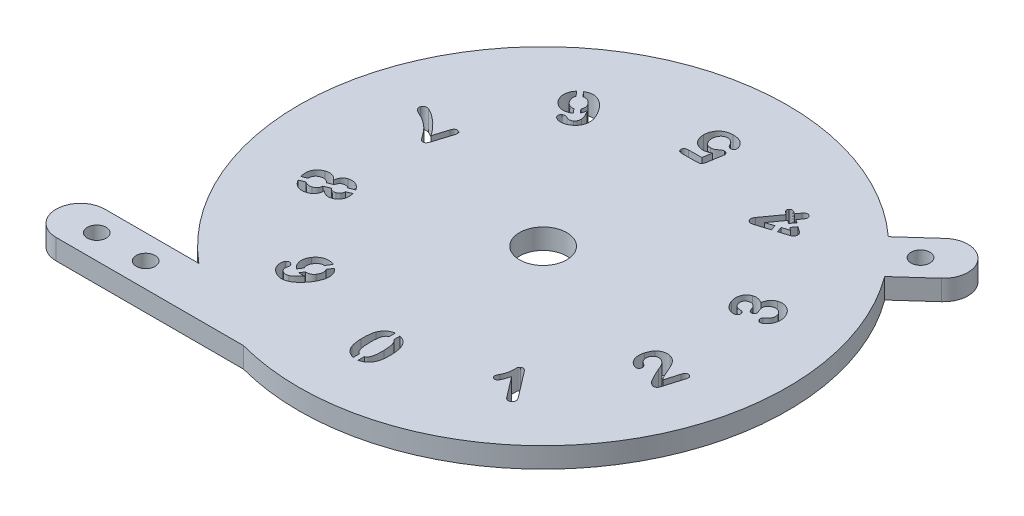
from build123d import *

# Parameters (mm, degrees)
SKETCH1_R             = 38.1
SKETCH1_R_2           = 3.683
BOSS_EXTRUDE1_DEPTH   = 3.175
CUT_EXTRUDE1_DEPTH    = 57.261143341
SKETCH6_W             = 0.762
SKETCH6_H             = 9.114087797
BOSS_EXTRUDE3_DEPTH   = 3.175
BOSS_EXTRUDE4_DEPTH   = 3.175
F_4_CLEARANCE_HOLE2_D = 2.9464


with BuildPart() as part:
    # Sketch1 → Boss-Extrude1 (new body)
    with BuildSketch(Plane(origin=(0, 0, 0), x_dir=(1, 0, 0), z_dir=(0, 1, 0))):
        with Locations(Location((0, 0, 0), (0, 0, 270))):
            Circle(SKETCH1_R)
        with Locations(Location((0, 0, 0), (0, 0, 270))):
            Circle(SKETCH1_R_2, mode=Mode.SUBTRACT)
    extrude(amount=BOSS_EXTRUDE1_DEPTH)

    # Sketch5 → Cut-Extrude1 (cut, through all)
    # profile 1 of 10: a face of its own
    with BuildSketch(Plane(origin=(0, 3.175, 3.175), x_dir=(1, 0, 0), z_dir=(0, 1, 0))):
        with BuildLine():
            add(Edge.make_bspline(
                [(24.679216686, 11.052980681), (24.656042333, 11.114369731), (24.610752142, 11.234343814), (24.509201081, 11.395492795), (24.385405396, 11.535141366), (24.262170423, 11.629483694), (24.154823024, 11.691076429), (24.069329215, 11.726334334), (23.980963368, 11.75150281), (23.888829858, 11.763945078), (23.793982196, 11.768514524), (23.695055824, 11.760143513), (23.593513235, 11.740166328), (23.525709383, 11.720405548), (23.491068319, 11.710309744)],
                knots=[0, 0, 0, 0, 1.544114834, 3.017700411, 4.462510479, 5.924567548, 6.654480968, 7.376067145, 8.099907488, 8.814688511, 9.563718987, 10.335078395, 11.149389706, 12, 12, 12, 12], degree=3))
            add(Edge.make_bspline(
                [(23.491068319, 11.710309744), (23.439710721, 11.690484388), (23.338849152, 11.651549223), (23.204530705, 11.560558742), (23.092069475, 11.444796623), (23.002318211, 11.307784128), (22.938351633, 11.153751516), (22.91082455, 10.985302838), (22.920777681, 10.80721469), (22.952772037, 10.689965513), (22.969378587, 10.629107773)],
                knots=[0, 0, 0, 0, 0.981610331, 1.927791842, 2.872983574, 3.849350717, 4.839292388, 5.83194494, 6.874679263, 8, 8, 8, 8], degree=3))
            add(Edge.make_bspline(
                [(22.969378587, 10.629107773), (22.983402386, 10.588381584), (23.010097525, 10.51085685), (23.060566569, 10.403477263), (23.115736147, 10.310215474), (23.176131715, 10.22996904), (23.242860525, 10.165024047), (23.30981533, 10.10791809), (23.381524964, 10.063490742), (23.482829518, 10.014236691), (23.630224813, 9.974440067), (23.821884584, 9.94314423), (24.023107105, 9.923784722), (24.157529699, 9.911313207), (24.22273817, 9.905263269)],
                knots=[0, 0, 0, 0, 0.982461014, 1.870173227, 2.702247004, 3.452378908, 4.153957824, 4.823442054, 5.456575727, 6.073406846, 7.388675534, 8.918696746, 10.505258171, 12, 12, 12, 12], degree=3))
            add(Edge.make_bspline(
                [(24.22273817, 9.905263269), (24.239037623, 9.902032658), (24.272378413, 9.895424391), (24.319960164, 9.871877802), (24.36556932, 9.839072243), (24.423689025, 9.781507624), (24.49001996, 9.691700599), (24.52173583, 9.606770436), (24.538360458, 9.562252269)],
                knots=[0, 0, 0, 0, 0.610016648, 1.247798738, 1.936837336, 2.673226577, 4.256192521, 6, 6, 6, 6], degree=3))
            add(Edge.make_bspline(
                [(24.538360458, 9.562252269), (24.545710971, 9.534193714), (24.560468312, 9.477861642), (24.559659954, 9.388040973), (24.538743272, 9.296780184), (24.501533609, 9.205619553), (24.447326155, 9.119037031), (24.373855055, 9.044370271), (24.281991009, 8.984691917), (24.212058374, 8.958789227), (24.175786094, 8.94535416)],
                knots=[0, 0, 0, 0, 0.873919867, 1.754535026, 2.682619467, 3.690650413, 4.718872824, 5.750533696, 6.833258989, 8, 8, 8, 8], degree=3))
            add(Edge.make_bspline(
                [(24.175786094, 8.94535416), (24.137324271, 8.934652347), (24.058787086, 8.912799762), (23.933436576, 8.901061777), (23.800479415, 8.903974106), (23.660618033, 8.922578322), (23.515370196, 8.956413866), (23.367724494, 9.008252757), (23.217755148, 9.075072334), (23.06624845, 9.156693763), (22.917089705, 9.257267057), (22.773783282, 9.37833079), (22.634812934, 9.5169482), (22.503918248, 9.674860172), (22.380825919, 9.849358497), (22.271171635, 10.041883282), (22.175998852, 10.251469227), (22.123606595, 10.39871439), (22.096852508, 10.473905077)],
                knots=[0, 0, 0, 0, 0.676176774, 1.380720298, 2.125791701, 2.92901026, 3.76984946, 4.651522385, 5.579370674, 6.552964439, 7.567598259, 8.625256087, 9.730892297, 10.8933701, 12.100611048, 13.34933765, 14.646440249, 16, 16, 16, 16], degree=3))
            add(Edge.make_bspline(
                [(22.096852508, 10.473905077), (22.076038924, 10.540528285), (22.035100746, 10.671569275), (21.996176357, 10.870161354), (21.970189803, 11.063967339), (21.962270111, 11.253435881), (21.971425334, 11.437620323), (21.996210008, 11.615710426), (22.03601093, 11.787327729), (22.094139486, 11.950296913), (22.164905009, 12.104343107), (22.25155741, 12.245856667), (22.351532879, 12.374651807), (22.464001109, 12.491383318), (22.588846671, 12.594089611), (22.725176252, 12.682259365), (22.870960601, 12.757268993), (22.974569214, 12.794784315), (23.026764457, 12.813683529)],
                knots=[0, 0, 0, 0, 1.188155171, 2.336978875, 3.442003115, 4.516734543, 5.562210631, 6.579153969, 7.576081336, 8.557456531, 9.521579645, 10.458907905, 11.377322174, 12.293853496, 13.214563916, 14.12451944, 15.055183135, 16, 16, 16, 16], degree=3))
            add(Edge.make_bspline(
                [(23.026764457, 12.813683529), (23.095915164, 12.83371583), (23.230038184, 12.87256999), (23.432758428, 12.900104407), (23.627969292, 12.900019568), (23.816711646, 12.867944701), (24.00310413, 12.812625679), (24.192274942, 12.737143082), (24.387768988, 12.643965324), (24.51466746, 12.566628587), (24.580095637, 12.526754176)],
                knots=[0, 0, 0, 0, 1.052826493, 2.042036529, 2.984009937, 3.899552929, 4.834122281, 5.825724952, 6.878955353, 8, 8, 8, 8], degree=3))
            add(Edge.make_bspline(
                [(24.580095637, 12.526754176), (24.591981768, 12.589940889), (24.615254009, 12.713656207), (24.661616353, 12.892828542), (24.720855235, 13.060455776), (24.789631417, 13.217282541), (24.868955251, 13.36255805), (24.959576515, 13.495224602), (25.060431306, 13.615825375), (25.171402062, 13.724764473), (25.293850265, 13.820336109), (25.425962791, 13.904192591), (25.568455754, 13.975221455), (25.669146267, 14.011103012), (25.719987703, 14.029220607)],
                knots=[0, 0, 0, 0, 1.161567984, 2.274271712, 3.340070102, 4.370545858, 5.365468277, 6.326316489, 7.26871724, 8.201939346, 9.130654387, 10.069907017, 11.025442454, 12, 12, 12, 12], degree=3))
            add(Edge.make_bspline(
                [(25.719987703, 14.029220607), (25.782703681, 14.047484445), (25.908043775, 14.083985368), (26.101884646, 14.115218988), (26.299097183, 14.123570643), (26.498377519, 14.113528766), (26.697741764, 14.082197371), (26.894997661, 14.029646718), (27.088395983, 13.955177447), (27.276241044, 13.857993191), (27.456775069, 13.741518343), (27.630862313, 13.609435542), (27.78908634, 13.452977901), (27.939696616, 13.282867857), (28.077402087, 13.094409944), (28.198095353, 12.887923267), (28.30395859, 12.664623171), (28.359008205, 12.506893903), (28.387126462, 12.426328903)],
                knots=[0, 0, 0, 0, 0.904679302, 1.808033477, 2.712772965, 3.635863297, 4.56896668, 5.504304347, 6.459857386, 7.435318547, 8.429760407, 9.434841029, 10.45746615, 11.507725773, 12.581485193, 13.686106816, 14.818108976, 16, 16, 16, 16], degree=3))
            add(Edge.make_bspline(
                [(28.387126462, 12.426328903), (28.411814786, 12.343710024), (28.460031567, 12.182353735), (28.503239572, 11.937957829), (28.519491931, 11.699575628), (28.508211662, 11.46843719), (28.476916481, 11.247753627), (28.429067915, 11.039362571), (28.363770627, 10.844818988), (28.281511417, 10.665483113), (28.186957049, 10.501092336), (28.085310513, 10.350385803), (27.976004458, 10.214449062), (27.860797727, 10.095764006), (27.746232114, 9.994814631), (27.636205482, 9.913476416), (27.534039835, 9.849842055), (27.464597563, 9.822649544), (27.432434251, 9.810054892)],
                knots=[0, 0, 0, 0, 1.361558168, 2.6591498, 3.912027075, 5.129085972, 6.308399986, 7.429756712, 8.502820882, 9.544854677, 10.541692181, 11.4961903, 12.414484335, 13.293746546, 14.106645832, 14.823793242, 15.455220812, 16, 16, 16, 16], degree=3))
            add(Edge.make_bspline(
                [(27.432434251, 9.810054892), (27.393605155, 9.79929072), (27.319041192, 9.778620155), (27.204614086, 9.77481755), (27.095480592, 9.794465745), (26.993722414, 9.838289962), (26.902234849, 9.900660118), (26.82490654, 9.981126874), (26.762652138, 10.07725163), (26.735517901, 10.149832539), (26.72163199, 10.186975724)],
                knots=[0, 0, 0, 0, 1.0689154, 2.052650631, 3.016812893, 3.996391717, 4.978085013, 5.943287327, 6.94747998, 8, 8, 8, 8], degree=3))
            add(Edge.make_bspline(
                [(26.72163199, 10.186975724), (26.712137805, 10.226713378), (26.69277449, 10.307758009), (26.701386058, 10.413140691), (26.723857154, 10.492043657), (26.745721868, 10.545132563), (26.773984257, 10.59033914), (26.798523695, 10.613879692), (26.810319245, 10.6251951)],
                knots=[0, 0, 0, 0, 1.559056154, 3.1796827, 3.976257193, 4.700525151, 5.375371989, 6, 6, 6, 6], degree=3))
            add(Edge.make_bspline(
                [(26.810319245, 10.6251951), (26.887608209, 10.690371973), (27.033758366, 10.813618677), (27.228993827, 11.00191381), (27.383187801, 11.185049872), (27.488007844, 11.334421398), (27.546856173, 11.455070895), (27.582530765, 11.545187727), (27.601910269, 11.640478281), (27.61488938, 11.738185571), (27.61337779, 11.839617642), (27.605500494, 11.944704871), (27.581886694, 12.053010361), (27.560690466, 12.12561918), (27.549814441, 12.162875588)],
                knots=[0, 0, 0, 0, 1.976491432, 3.737461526, 5.293622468, 6.653755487, 7.288524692, 7.915219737, 8.542087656, 9.184098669, 9.838534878, 10.521066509, 11.241142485, 12, 12, 12, 12], degree=3))
            add(Edge.make_bspline(
                [(27.549814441, 12.162875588), (27.53444249, 12.205547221), (27.503749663, 12.290748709), (27.436978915, 12.409785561), (27.356604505, 12.521492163), (27.263335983, 12.625501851), (27.156577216, 12.719107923), (27.035268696, 12.795389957), (26.903811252, 12.859702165), (26.760820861, 12.903880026), (26.610751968, 12.932939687), (26.455529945, 12.93559552), (26.296697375, 12.918209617), (26.19307283, 12.887908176), (26.139947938, 12.872373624)],
                knots=[0, 0, 0, 0, 0.927930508, 1.852777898, 2.784675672, 3.743347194, 4.709479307, 5.682974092, 6.670989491, 7.69918135, 8.740446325, 9.791833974, 10.867945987, 12, 12, 12, 12], degree=3))
            add(Edge.make_bspline(
                [(26.139947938, 12.872373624), (26.101377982, 12.859241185), (26.025954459, 12.833560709), (25.920395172, 12.78268792), (25.822592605, 12.728830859), (25.733711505, 12.668453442), (25.655288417, 12.600268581), (25.586081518, 12.525698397), (25.52532571, 12.445562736), (25.474347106, 12.359454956), (25.43396319, 12.267865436), (25.403718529, 12.172076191), (25.384415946, 12.072767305), (25.374657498, 11.969597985), (25.378480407, 11.863044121), (25.389734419, 11.752083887), (25.413433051, 11.637762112), (25.436786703, 11.561456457), (25.448709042, 11.522501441)],
                knots=[0, 0, 0, 0, 1.135419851, 2.220312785, 3.262627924, 4.248096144, 5.210847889, 6.154628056, 7.081033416, 8.010607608, 8.938915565, 9.866985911, 10.806315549, 11.755919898, 12.750521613, 13.774908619, 14.864062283, 16, 16, 16, 16], degree=3))
            add(Edge.make_bspline(
                [(25.448709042, 11.522501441), (25.454333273, 11.506841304), (25.467025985, 11.471499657), (25.488847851, 11.412919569), (25.518031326, 11.344154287), (25.550247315, 11.268530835), (25.581804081, 11.194982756), (25.609977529, 11.133074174), (25.628350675, 11.085346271), (25.637859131, 11.058645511), (25.641734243, 11.047763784)],
                knots=[0, 0, 0, 0, 0.779032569, 1.758113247, 2.926085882, 4.275716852, 5.606648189, 6.673018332, 7.459196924, 8, 8, 8, 8], degree=3))
            add(Edge.make_bspline(
                [(25.641734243, 11.047763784), (25.65245532, 11.011075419), (25.672872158, 10.941207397), (25.684138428, 10.836553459), (25.675381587, 10.739740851), (25.647691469, 10.652123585), (25.603112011, 10.574919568), (25.540460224, 10.51117498), (25.463683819, 10.457091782), (25.403304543, 10.434725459), (25.371759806, 10.423040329)],
                knots=[0, 0, 0, 0, 1.188410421, 2.263166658, 3.255774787, 4.193233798, 5.103223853, 6.003091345, 6.956728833, 8, 8, 8, 8], degree=3))
            add(Edge.make_bspline(
                [(25.371759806, 10.423040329), (25.339391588, 10.414484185), (25.276630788, 10.397894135), (25.179918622, 10.400050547), (25.087114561, 10.422766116), (24.998421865, 10.46814866), (24.91635502, 10.537271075), (24.846536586, 10.631715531), (24.78263112, 10.746665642), (24.751766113, 10.834147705), (24.735298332, 10.880823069)],
                knots=[0, 0, 0, 0, 0.905891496, 1.756490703, 2.595943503, 3.483472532, 4.439355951, 5.48369825, 6.657447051, 8, 8, 8, 8], degree=3))
            Line((24.735298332, 10.880823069), (24.679216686, 11.052980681))
        make_face()
    # profile 2 of 10: a face of its own
    with BuildSketch(Plane(origin=(0, 3.175, 3.175), x_dir=(1, 0, 0), z_dir=(0, 1, 0))):
        with BuildLine():
            Line((16.6288275, 27.159491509), (16.13191803, 26.470861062))
            Line((16.13191803, 26.470861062), (17.933051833, 25.171853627))
            add(Edge.make_bspline(
                [(17.933051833, 25.171853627), (17.985319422, 25.132142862), (18.083987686, 25.057178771), (18.202666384, 24.926744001), (18.28921425, 24.793008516), (18.336719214, 24.653591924), (18.352028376, 24.513452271), (18.333633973, 24.374750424), (18.286315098, 24.236529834), (18.231568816, 24.153502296), (18.203026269, 24.11021502)],
                knots=[0, 0, 0, 0, 1.26530587, 2.388584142, 3.387971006, 4.319876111, 5.206232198, 6.08616345, 7.002201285, 8, 8, 8, 8], degree=3))
            add(Edge.make_bspline(
                [(18.203026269, 24.11021502), (18.185077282, 24.08818496), (18.148724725, 24.043566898), (18.078017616, 23.988170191), (17.993839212, 23.939638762), (17.897263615, 23.896997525), (17.792468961, 23.861174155), (17.683636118, 23.824138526), (17.562281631, 23.788274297), (17.476569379, 23.76286345), (17.42962124, 23.74894488)],
                knots=[0, 0, 0, 0, 0.783772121, 1.587394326, 2.46577876, 3.466756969, 4.501112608, 5.527612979, 6.645771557, 8, 8, 8, 8], degree=3))
            Line((17.42962124, 23.74894488), (13.707364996, 22.594706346))
            add(Edge.make_bspline(
                [(13.707364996, 22.594706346), (13.64971869, 22.576691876), (13.541938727, 22.543010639), (13.388606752, 22.505059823), (13.257003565, 22.473239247), (13.142420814, 22.454854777), (13.038625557, 22.450539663), (12.940837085, 22.466100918), (12.847442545, 22.502653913), (12.790823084, 22.538507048), (12.761802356, 22.556883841)],
                knots=[0, 0, 0, 0, 1.47134596, 2.750941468, 3.848328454, 4.769762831, 5.575185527, 6.369382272, 7.164214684, 8, 8, 8, 8], degree=3))
            add(Edge.make_bspline(
                [(12.761802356, 22.556883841), (12.719214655, 22.590224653), (12.638649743, 22.653296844), (12.542938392, 22.765888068), (12.480752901, 22.887463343), (12.450921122, 23.016961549), (12.454601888, 23.153293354), (12.490751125, 23.295187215), (12.557697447, 23.443670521), (12.621938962, 23.53818028), (12.656160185, 23.588525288)],
                knots=[0, 0, 0, 0, 1.091835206, 2.06546978, 2.961862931, 3.827688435, 4.724555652, 5.692577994, 6.770844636, 8, 8, 8, 8], degree=3))
            Line((12.656160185, 23.588525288), (14.671186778, 26.382173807))
            Line((14.671186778, 26.382173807), (14.515984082, 26.4943371))
            add(Edge.make_bspline(
                [(14.515984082, 26.4943371), (14.472770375, 26.526630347), (14.390834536, 26.587860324), (14.283255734, 26.686761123), (14.193793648, 26.782665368), (14.123299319, 26.877510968), (14.07741758, 26.978662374), (14.074949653, 27.089841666), (14.110444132, 27.204425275), (14.15619514, 27.274436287), (14.180798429, 27.312085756)],
                knots=[0, 0, 0, 0, 1.274974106, 2.417429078, 3.450627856, 4.372057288, 5.206379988, 6.029415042, 6.940288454, 8, 8, 8, 8], degree=3))
            add(Edge.make_bspline(
                [(14.180798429, 27.312085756), (14.20429749, 27.341599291), (14.248620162, 27.39726614), (14.332509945, 27.458406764), (14.424222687, 27.494498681), (14.524376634, 27.500890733), (14.631770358, 27.483953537), (14.746226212, 27.441318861), (14.87055542, 27.378056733), (14.951413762, 27.321466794), (14.994634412, 27.291218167)],
                knots=[0, 0, 0, 0, 0.972672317, 1.83460245, 2.65368551, 3.488989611, 4.399136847, 5.448859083, 6.636356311, 8, 8, 8, 8], degree=3))
            Line((14.994634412, 27.291218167), (15.2137441, 27.133407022))
            Line((15.2137441, 27.133407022), (15.710653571, 27.82203747))
            add(Edge.make_bspline(
                [(15.710653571, 27.82203747), (15.744258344, 27.865646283), (15.807562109, 27.947795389), (15.914526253, 28.048623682), (16.025032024, 28.119389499), (16.138066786, 28.160133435), (16.251462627, 28.171274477), (16.364100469, 28.160349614), (16.474113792, 28.119405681), (16.54088768, 28.076391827), (16.575354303, 28.054189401)],
                knots=[0, 0, 0, 0, 1.299575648, 2.448105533, 3.454259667, 4.380234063, 5.258299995, 6.126150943, 7.032776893, 8, 8, 8, 8], degree=3))
            add(Edge.make_bspline(
                [(16.575354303, 28.054189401), (16.606923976, 28.028875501), (16.668076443, 27.979840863), (16.739401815, 27.887480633), (16.785449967, 27.783128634), (16.809669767, 27.669413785), (16.806592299, 27.547549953), (16.773918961, 27.4205796), (16.716379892, 27.287761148), (16.659076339, 27.203807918), (16.6288275, 27.159491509)],
                knots=[0, 0, 0, 0, 0.956814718, 1.853411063, 2.734415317, 3.639851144, 4.588137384, 5.595397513, 6.730681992, 8, 8, 8, 8], degree=3))
        make_face()
        Polygon((17.132258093, 24.607124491), (15.589360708, 25.719627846), (14.084285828, 23.632868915), align=None, mode=Mode.SUBTRACT)
    # profile 3 of 10: a face of its own
    with BuildSketch(Plane(origin=(0, 3.175, 3.175), x_dir=(1, 0, 0), z_dir=(0, 1, 0))):
        with BuildLine():
            Line((-1.70121064, 27.508408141), (0.390765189, 27.522754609))
            Line((0.390765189, 27.522754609), (0.630742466, 28.963922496))
            add(Edge.make_bspline(
                [(0.630742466, 28.963922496), (0.579714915, 28.93558162), (0.479723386, 28.880045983), (0.32810719, 28.807159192), (0.179910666, 28.744274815), (0.034558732, 28.692812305), (-0.108088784, 28.653667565), (-0.247914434, 28.624966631), (-0.384713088, 28.605523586), (-0.475178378, 28.602722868), (-0.519583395, 28.601348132)],
                knots=[0, 0, 0, 0, 1.148888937, 2.2513164, 3.309951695, 4.316883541, 5.28445505, 6.219377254, 7.125978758, 8, 8, 8, 8], degree=3))
            add(Edge.make_bspline(
                [(-0.519583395, 28.601348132), (-0.588806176, 28.602987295), (-0.726120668, 28.606238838), (-0.928474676, 28.635705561), (-1.124287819, 28.683983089), (-1.312072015, 28.752079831), (-1.490852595, 28.837429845), (-1.656350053, 28.94186782), (-1.812286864, 29.058013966), (-1.954204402, 29.191208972), (-2.081792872, 29.3391228), (-2.196672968, 29.499277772), (-2.295117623, 29.673309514), (-2.380334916, 29.858390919), (-2.448215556, 30.054480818), (-2.497368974, 30.258849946), (-2.528655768, 30.471085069), (-2.532603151, 30.614960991), (-2.534609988, 30.688107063)],
                knots=[0, 0, 0, 0, 1.026411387, 2.036051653, 3.026162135, 4.01353837, 4.994257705, 5.958834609, 6.912025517, 7.874768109, 8.83940969, 9.805774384, 10.793677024, 11.800842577, 12.824697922, 13.866453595, 14.915311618, 16, 16, 16, 16], degree=3))
            add(Edge.make_bspline(
                [(-2.534609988, 30.688107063), (-2.532462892, 30.793516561), (-2.528249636, 31.000362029), (-2.476873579, 31.303565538), (-2.391982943, 31.591634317), (-2.293287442, 31.819978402), (-2.195645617, 31.991026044), (-2.116467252, 32.114882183), (-2.027063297, 32.230194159), (-1.932321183, 32.340979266), (-1.827117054, 32.442490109), (-1.714881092, 32.537516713), (-1.59561861, 32.627170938), (-1.468073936, 32.708610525), (-1.334381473, 32.783237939), (-1.193782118, 32.847320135), (-1.048037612, 32.901575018), (-0.897178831, 32.948039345), (-0.740179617, 32.983167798), (-0.577530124, 33.00720011), (-0.40947728, 33.023509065), (-0.295729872, 33.026409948), (-0.237870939, 33.027885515)],
                knots=[0, 0, 0, 0, 1.716953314, 3.369184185, 4.995073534, 6.604192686, 7.410335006, 8.204549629, 8.998384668, 9.787141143, 10.579043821, 11.378553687, 12.183698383, 13.009418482, 13.843762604, 14.677865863, 15.525648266, 16.377627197, 17.249393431, 18.145510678, 19.056692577, 20, 20, 20, 20], degree=3))
            add(Edge.make_bspline(
                [(-0.237870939, 33.027885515), (-0.17349638, 33.027885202), (-0.048077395, 33.027884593), (0.135486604, 33.013354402), (0.310009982, 32.994233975), (0.47473363, 32.961725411), (0.630900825, 32.923902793), (0.776784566, 32.873319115), (0.915070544, 32.816958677), (1.08101054, 32.726998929), (1.267946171, 32.605734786), (1.462979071, 32.446358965), (1.624426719, 32.276531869), (1.744410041, 32.093924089), (1.833964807, 31.914201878), (1.901289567, 31.744499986), (1.943114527, 31.585257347), (1.949096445, 31.481720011), (1.951921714, 31.432819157)],
                knots=[0, 0, 0, 0, 1.031934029, 2.010485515, 2.951355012, 3.845607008, 4.701220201, 5.525791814, 6.319516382, 7.092987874, 8.54911193, 9.886334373, 11.124527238, 12.290522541, 13.375564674, 14.34013274, 15.216041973, 16, 16, 16, 16], degree=3))
            add(Edge.make_bspline(
                [(1.951921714, 31.432819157), (1.950597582, 31.40435974), (1.947932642, 31.347082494), (1.919948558, 31.263103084), (1.874094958, 31.182345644), (1.812625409, 31.106008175), (1.738949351, 31.038461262), (1.65263053, 30.987978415), (1.555916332, 30.959240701), (1.488235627, 30.955018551), (1.453708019, 30.952864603)],
                knots=[0, 0, 0, 0, 0.891878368, 1.794988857, 2.749159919, 3.798999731, 4.863320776, 5.873375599, 6.915093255, 8, 8, 8, 8], degree=3))
            add(Edge.make_bspline(
                [(1.453708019, 30.952864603), (1.423602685, 30.954048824), (1.364891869, 30.956358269), (1.280116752, 30.976416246), (1.201593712, 31.010077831), (1.127669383, 31.05567157), (1.060918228, 31.116868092), (1.000779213, 31.191173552), (0.945591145, 31.277831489), (0.915223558, 31.342015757), (0.899412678, 31.375433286)],
                knots=[0, 0, 0, 0, 0.972011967, 1.895598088, 2.795913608, 3.723764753, 4.68874451, 5.706978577, 6.80613873, 8, 8, 8, 8], degree=3))
            add(Edge.make_bspline(
                [(0.899412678, 31.375433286), (0.868724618, 31.437560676), (0.808796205, 31.558884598), (0.69602556, 31.722911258), (0.566645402, 31.864354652), (0.42355242, 31.982831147), (0.269092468, 32.078442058), (0.103648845, 32.145007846), (-0.070045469, 32.187913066), (-0.189362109, 32.191414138), (-0.249608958, 32.193181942)],
                knots=[0, 0, 0, 0, 1.111669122, 2.170895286, 3.183835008, 4.180477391, 5.145492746, 6.087973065, 7.034555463, 8, 8, 8, 8], degree=3))
            add(Edge.make_bspline(
                [(-0.249608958, 32.193181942), (-0.304565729, 32.190935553), (-0.412090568, 32.186540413), (-0.567557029, 32.151853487), (-0.712198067, 32.094856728), (-0.844958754, 32.016698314), (-0.964505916, 31.918677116), (-1.071255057, 31.804879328), (-1.161228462, 31.672710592), (-1.236639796, 31.526340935), (-1.296918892, 31.367205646), (-1.337961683, 31.19628226), (-1.363435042, 31.015372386), (-1.366010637, 30.891219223), (-1.367329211, 30.827659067)],
                knots=[0, 0, 0, 0, 0.999812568, 1.956168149, 2.883591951, 3.820224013, 4.748559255, 5.689395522, 6.651009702, 7.649286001, 8.68125685, 9.740901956, 10.843455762, 12, 12, 12, 12], degree=3))
            add(Edge.make_bspline(
                [(-1.367329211, 30.827659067), (-1.365499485, 30.759691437), (-1.361973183, 30.628702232), (-1.330061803, 30.440163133), (-1.285278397, 30.265846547), (-1.217630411, 30.108622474), (-1.136070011, 29.968444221), (-1.039765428, 29.84734816), (-0.932313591, 29.743710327), (-0.811460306, 29.661415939), (-0.680826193, 29.598906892), (-0.543517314, 29.552453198), (-0.398410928, 29.526312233), (-0.29970376, 29.522673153), (-0.249608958, 29.520826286)],
                knots=[0, 0, 0, 0, 1.263773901, 2.435582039, 3.550337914, 4.60523891, 5.609828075, 6.560003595, 7.475623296, 8.377739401, 9.267876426, 10.163328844, 11.067872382, 12, 12, 12, 12], degree=3))
            add(Edge.make_bspline(
                [(-0.249608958, 29.520826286), (-0.190809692, 29.521679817), (-0.081964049, 29.523259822), (0.067345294, 29.544260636), (0.191720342, 29.568969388), (0.294016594, 29.615547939), (0.388538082, 29.67785366), (0.496847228, 29.750208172), (0.622116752, 29.840855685), (0.757767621, 29.943859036), (0.895704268, 30.042575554), (1.02734915, 30.118601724), (1.147392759, 30.167649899), (1.225128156, 30.175753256), (1.260682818, 30.179459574)],
                knots=[0, 0, 0, 0, 1.253037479, 2.319547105, 3.214995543, 3.945812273, 4.699919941, 5.628618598, 6.725196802, 7.99778703, 9.263734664, 10.339441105, 11.240492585, 12, 12, 12, 12], degree=3))
            add(Edge.make_bspline(
                [(1.260682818, 30.179459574), (1.296094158, 30.177851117), (1.365966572, 30.174677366), (1.467452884, 30.144740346), (1.56154285, 30.093962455), (1.645455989, 30.024709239), (1.719689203, 29.946888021), (1.77305864, 29.858196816), (1.807821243, 29.764169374), (1.812589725, 29.698491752), (1.814978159, 29.665595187)],
                knots=[0, 0, 0, 0, 1.019773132, 2.012180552, 3.022265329, 4.083987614, 5.140361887, 6.108372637, 7.052522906, 8, 8, 8, 8], degree=3))
            add(Edge.make_bspline(
                [(1.814978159, 29.665595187), (1.814201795, 29.656453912), (1.811749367, 29.627577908), (1.800859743, 29.568296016), (1.787825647, 29.47631245), (1.775236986, 29.404277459), (1.768026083, 29.363015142)],
                knots=[0, 0, 0, 0, 0.359337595, 1.135096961, 2.35895671, 4, 4, 4, 4], degree=3))
            Line((1.768026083, 29.363015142), (1.413277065, 27.226695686))
            add(Edge.make_bspline(
                [(1.413277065, 27.226695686), (1.402429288, 27.169444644), (1.38200413, 27.061647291), (1.333101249, 26.913443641), (1.268864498, 26.790826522), (1.192276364, 26.688239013), (1.090143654, 26.612058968), (0.963647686, 26.560954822), (0.812345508, 26.528263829), (0.702668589, 26.524457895), (0.643784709, 26.522414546)],
                knots=[0, 0, 0, 0, 1.19295133, 2.246194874, 3.182316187, 4.019608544, 4.846032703, 5.755774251, 6.795109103, 8, 8, 8, 8], degree=3))
            Line((0.643784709, 26.522414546), (-1.668605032, 26.506763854))
            add(Edge.make_bspline(
                [(-1.668605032, 26.506763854), (-1.720469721, 26.507424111), (-1.817865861, 26.508663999), (-1.953657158, 26.53306177), (-2.070576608, 26.568667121), (-2.16671476, 26.624875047), (-2.241680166, 26.697931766), (-2.295405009, 26.787720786), (-2.329031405, 26.893102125), (-2.332133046, 26.969060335), (-2.333759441, 27.008890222)],
                knots=[0, 0, 0, 0, 1.307601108, 2.455529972, 3.472751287, 4.37839915, 5.240128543, 6.087400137, 6.997098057, 8, 8, 8, 8], degree=3))
            add(Edge.make_bspline(
                [(-2.333759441, 27.008890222), (-2.33220753, 27.044296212), (-2.329200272, 27.112905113), (-2.300036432, 27.210744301), (-2.248221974, 27.296907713), (-2.176692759, 27.371692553), (-2.085478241, 27.434452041), (-1.972982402, 27.475850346), (-1.8434743, 27.504319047), (-1.7505179, 27.506990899), (-1.70121064, 27.508408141)],
                knots=[0, 0, 0, 0, 0.932266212, 1.806523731, 2.660005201, 3.560343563, 4.517660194, 5.552527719, 6.701776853, 8, 8, 8, 8], degree=3))
        make_face()
    # profile 4 of 10: a face of its own
    with BuildSketch(Plane(origin=(0, 3.175, 3.175), x_dir=(1, 0, 0), z_dir=(0, 1, 0))):
        with BuildLine():
            add(Edge.make_bspline(
                [(-14.863127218, 24.901717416), (-14.870409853, 24.826315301), (-14.88461454, 24.679244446), (-14.929023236, 24.467057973), (-14.99326585, 24.269356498), (-15.077051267, 24.085416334), (-15.181409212, 23.913921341), (-15.306042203, 23.754173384), (-15.452241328, 23.604923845), (-15.562912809, 23.517201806), (-15.61957733, 23.472287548)],
                knots=[0, 0, 0, 0, 1.086113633, 2.118450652, 3.102585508, 4.062613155, 5.011331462, 5.975664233, 6.963526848, 8, 8, 8, 8], degree=3))
            add(Edge.make_bspline(
                [(-15.61957733, 23.472287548), (-15.676128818, 23.432261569), (-15.787823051, 23.353206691), (-15.967817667, 23.259187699), (-16.15105063, 23.18191909), (-16.339473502, 23.127654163), (-16.530351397, 23.092278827), (-16.723117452, 23.075931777), (-16.916627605, 23.082296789), (-17.109976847, 23.104761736), (-17.300901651, 23.149716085), (-17.487914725, 23.214370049), (-17.671668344, 23.296243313), (-17.8480485, 23.399508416), (-18.015519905, 23.519396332), (-18.173334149, 23.652963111), (-18.318528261, 23.801371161), (-18.404193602, 23.910553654), (-18.447135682, 23.965284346)],
                knots=[0, 0, 0, 0, 1.037168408, 2.048500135, 3.035749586, 4.012974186, 4.980267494, 5.941133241, 6.905680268, 7.876980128, 8.853596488, 9.838392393, 10.838562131, 11.863214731, 12.895460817, 13.921500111, 14.958095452, 16, 16, 16, 16], degree=3))
            add(Edge.make_bspline(
                [(-18.447135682, 23.965284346), (-18.476853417, 24.006626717), (-18.535391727, 24.088063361), (-18.61242037, 24.216284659), (-18.68205666, 24.3458839), (-18.740285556, 24.4792677), (-18.790219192, 24.614166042), (-18.831458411, 24.75161384), (-18.860239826, 24.892374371), (-18.890797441, 25.081283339), (-18.902239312, 25.318609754), (-18.877469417, 25.601277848), (-18.812855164, 25.878253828), (-18.726769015, 26.102390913), (-18.638942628, 26.275494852), (-18.564771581, 26.402772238), (-18.480470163, 26.524020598), (-18.389099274, 26.641994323), (-18.288760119, 26.755574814), (-18.178406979, 26.863857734), (-18.060290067, 26.968354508), (-17.9758484, 27.032887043), (-17.933271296, 27.065425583)],
                knots=[0, 0, 0, 0, 0.867860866, 1.709521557, 2.548533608, 3.375006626, 4.18888248, 5.000493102, 5.819082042, 6.636898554, 8.262454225, 9.855137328, 11.460964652, 13.096547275, 13.935330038, 14.769382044, 15.606295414, 16.451539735, 17.31282159, 18.188248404, 19.08648016, 20, 20, 20, 20], degree=3))
            add(Edge.make_bspline(
                [(-17.933271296, 27.065425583), (-17.883292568, 27.101301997), (-17.784968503, 27.171882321), (-17.631648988, 27.264986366), (-17.476311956, 27.343740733), (-17.320865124, 27.413355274), (-17.162302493, 27.465877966), (-17.003069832, 27.508400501), (-16.842084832, 27.537054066), (-16.679842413, 27.552835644), (-16.516745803, 27.555245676), (-16.353043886, 27.545369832), (-16.189824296, 27.519394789), (-16.02634065, 27.483808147), (-15.863419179, 27.43195961), (-15.701274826, 27.366531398), (-15.53805457, 27.289146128), (-15.375688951, 27.19784319), (-15.213728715, 27.093221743), (-15.053245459, 26.975404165), (-14.893968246, 26.845184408), (-14.737523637, 26.700345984), (-14.580256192, 26.544643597), (-14.42768298, 26.37240067), (-14.272221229, 26.190727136), (-14.174668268, 26.060862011), (-14.124936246, 25.994657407)],
                knots=[0, 0, 0, 0, 0.988404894, 1.944507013, 2.878714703, 3.78596802, 4.678496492, 5.559632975, 6.432561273, 7.302885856, 8.176261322, 9.051311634, 9.934605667, 10.829509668, 11.737623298, 12.678157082, 13.637495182, 14.638363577, 15.669282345, 16.734039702, 17.836074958, 18.9733312, 20.158913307, 21.390630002, 22.669755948, 24, 24, 24, 24], degree=3))
            add(Edge.make_bspline(
                [(-14.124936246, 25.994657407), (-14.04663737, 25.886022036), (-13.893897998, 25.674104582), (-13.693160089, 25.349002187), (-13.522338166, 25.028559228), (-13.382338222, 24.713549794), (-13.2738643, 24.406047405), (-13.195048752, 24.108811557), (-13.150141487, 23.822039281), (-13.136505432, 23.546096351), (-13.153083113, 23.280852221), (-13.199841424, 23.026243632), (-13.277816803, 22.782321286), (-13.385354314, 22.549461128), (-13.521763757, 22.327737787), (-13.688192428, 22.119084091), (-13.882853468, 21.92210324), (-14.030976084, 21.806089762), (-14.106677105, 21.746798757)],
                knots=[0, 0, 0, 0, 1.337866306, 2.609805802, 3.814749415, 4.964284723, 6.051130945, 7.070083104, 8.032911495, 8.94627595, 9.82566662, 10.682874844, 11.526478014, 12.377897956, 13.239991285, 14.12135431, 15.0398806, 16, 16, 16, 16], degree=3))
            add(Edge.make_bspline(
                [(-14.106677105, 21.746798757), (-14.182080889, 21.693733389), (-14.329431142, 21.590035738), (-14.564027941, 21.467710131), (-14.800804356, 21.375455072), (-15.038503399, 21.318864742), (-15.270119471, 21.292370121), (-15.490736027, 21.287688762), (-15.698136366, 21.312803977), (-15.889747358, 21.361773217), (-16.061525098, 21.432204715), (-16.211820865, 21.517025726), (-16.34009539, 21.615415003), (-16.406436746, 21.695091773), (-16.438630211, 21.733756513)],
                knots=[0, 0, 0, 0, 1.294020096, 2.528708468, 3.70593908, 4.855343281, 5.949902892, 6.975927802, 7.947762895, 8.874980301, 9.745930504, 10.547326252, 11.295061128, 12, 12, 12, 12], degree=3))
            add(Edge.make_bspline(
                [(-16.438630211, 21.733756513), (-16.454593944, 21.758377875), (-16.486325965, 21.807319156), (-16.5132649, 21.892444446), (-16.525095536, 21.983822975), (-16.519749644, 22.080256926), (-16.496713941, 22.176560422), (-16.454400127, 22.267125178), (-16.391772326, 22.348377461), (-16.338303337, 22.392090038), (-16.310816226, 22.414561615)],
                knots=[0, 0, 0, 0, 0.914527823, 1.817859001, 2.764401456, 3.786059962, 4.822016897, 5.844309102, 6.891811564, 8, 8, 8, 8], degree=3))
            add(Edge.make_bspline(
                [(-16.310816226, 22.414561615), (-16.284367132, 22.432392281), (-16.231555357, 22.467995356), (-16.143231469, 22.505708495), (-16.04942918, 22.52908485), (-15.951535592, 22.539563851), (-15.851689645, 22.535897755), (-15.752374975, 22.516353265), (-15.656050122, 22.478801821), (-15.595681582, 22.444067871), (-15.564799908, 22.426299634)],
                knots=[0, 0, 0, 0, 0.962913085, 1.922680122, 2.885593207, 3.877155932, 4.890185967, 5.89568153, 6.92353078, 8, 8, 8, 8], degree=3))
            add(Edge.make_bspline(
                [(-15.564799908, 22.426299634), (-15.524974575, 22.40293452), (-15.447003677, 22.357189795), (-15.320675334, 22.309560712), (-15.190456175, 22.282489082), (-15.057394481, 22.272734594), (-14.924325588, 22.284377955), (-14.79496821, 22.317578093), (-14.670324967, 22.371196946), (-14.595009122, 22.422388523), (-14.5566345, 22.448471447)],
                knots=[0, 0, 0, 0, 1.030117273, 2.01678585, 2.999671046, 3.992629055, 4.987105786, 5.969367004, 6.965360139, 8, 8, 8, 8], degree=3))
            add(Edge.make_bspline(
                [(-14.5566345, 22.448471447), (-14.526680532, 22.472820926), (-14.466295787, 22.521907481), (-14.389584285, 22.61284195), (-14.320921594, 22.714571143), (-14.265802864, 22.829662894), (-14.222017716, 22.952570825), (-14.189956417, 23.080833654), (-14.174073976, 23.214080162), (-14.175219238, 23.304009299), (-14.175800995, 23.349690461)],
                knots=[0, 0, 0, 0, 0.91024153, 1.834972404, 2.797878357, 3.80392026, 4.840336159, 5.876701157, 6.921431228, 8, 8, 8, 8], degree=3))
            add(Edge.make_bspline(
                [(-14.175800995, 23.349690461), (-14.179906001, 23.398972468), (-14.188560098, 23.502867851), (-14.225738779, 23.664084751), (-14.283107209, 23.837967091), (-14.358892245, 24.025973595), (-14.456446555, 24.226527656), (-14.57299796, 24.440412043), (-14.708995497, 24.668096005), (-14.810329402, 24.82169041), (-14.863127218, 24.901717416)],
                knots=[0, 0, 0, 0, 0.691183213, 1.457139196, 2.307336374, 3.251588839, 4.290818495, 5.425764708, 6.658750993, 8, 8, 8, 8], degree=3))
        make_face()
        with BuildLine():
            add(Edge.make_bspline(
                [(-17.376367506, 26.312888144), (-17.404820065, 26.290999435), (-17.460602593, 26.248085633), (-17.532666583, 26.172066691), (-17.595033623, 26.091610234), (-17.648749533, 26.005601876), (-17.689913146, 25.912770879), (-17.721656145, 25.813994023), (-17.742247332, 25.709380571), (-17.752393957, 25.599729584), (-17.75275039, 25.487442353), (-17.740661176, 25.373829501), (-17.717071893, 25.260810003), (-17.68242331, 25.147582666), (-17.638323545, 25.033833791), (-17.581688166, 24.92014047), (-17.513741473, 24.806568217), (-17.461648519, 24.733134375), (-17.435057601, 24.695649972)],
                knots=[0, 0, 0, 0, 0.950133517, 1.862779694, 2.76621511, 3.645598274, 4.542914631, 5.450235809, 6.390255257, 7.362487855, 8.36490719, 9.361215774, 10.384865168, 11.420056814, 12.496306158, 13.614480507, 14.782308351, 16, 16, 16, 16], degree=3))
            add(Edge.make_bspline(
                [(-17.435057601, 24.695649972), (-17.396306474, 24.647148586), (-17.321278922, 24.553243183), (-17.198772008, 24.427650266), (-17.068441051, 24.325798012), (-16.935154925, 24.242385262), (-16.798310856, 24.180431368), (-16.659176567, 24.141593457), (-16.520774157, 24.119119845), (-16.382544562, 24.121121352), (-16.248096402, 24.142503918), (-16.117615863, 24.179780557), (-15.993918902, 24.237807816), (-15.918482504, 24.288992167), (-15.880422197, 24.314816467)],
                knots=[0, 0, 0, 0, 1.245336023, 2.411143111, 3.510572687, 4.556369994, 5.559874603, 6.512457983, 7.447587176, 8.363560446, 9.272821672, 10.1727034, 11.078064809, 12, 12, 12, 12], degree=3))
            add(Edge.make_bspline(
                [(-15.880422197, 24.314816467), (-15.845641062, 24.343013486), (-15.776364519, 24.399175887), (-15.687697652, 24.500384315), (-15.609794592, 24.611242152), (-15.547504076, 24.734326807), (-15.500471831, 24.865636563), (-15.471057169, 25.004255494), (-15.462879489, 25.148229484), (-15.471532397, 25.296465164), (-15.501691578, 25.446177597), (-15.553512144, 25.595196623), (-15.626616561, 25.74249411), (-15.690915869, 25.834150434), (-15.723915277, 25.88118989)],
                knots=[0, 0, 0, 0, 0.916838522, 1.826145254, 2.748732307, 3.689833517, 4.645895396, 5.60245609, 6.585253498, 7.594747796, 8.640450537, 9.70633431, 10.822854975, 12, 12, 12, 12], degree=3))
            add(Edge.make_bspline(
                [(-15.723915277, 25.88118989), (-15.752527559, 25.91812894), (-15.808654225, 25.990589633), (-15.899913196, 26.089973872), (-15.996171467, 26.177625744), (-16.095147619, 26.256927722), (-16.199652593, 26.323997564), (-16.30704366, 26.38297146), (-16.420125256, 26.427670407), (-16.534939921, 26.464604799), (-16.650771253, 26.489112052), (-16.764278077, 26.502775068), (-16.874677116, 26.5031223), (-16.9817455, 26.489331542), (-17.086289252, 26.465276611), (-17.187037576, 26.426555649), (-17.285115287, 26.377023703), (-17.345552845, 26.334545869), (-17.376367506, 26.312888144)],
                knots=[0, 0, 0, 0, 1.177726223, 2.310261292, 3.396333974, 4.45767799, 5.503513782, 6.523528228, 7.541243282, 8.563904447, 9.561409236, 10.521288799, 11.44200686, 12.336582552, 13.237848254, 14.139713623, 15.051515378, 16, 16, 16, 16], degree=3))
        make_face(mode=Mode.SUBTRACT)
    # profile 5 of 10: a face of its own
    with BuildSketch(Plane(origin=(0, 3.175, 3.175), x_dir=(1, 0, 0), z_dir=(0, 1, 0))):
        with BuildLine():
            Line((-21.9695444, 11.291087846), (-22.83946203, 8.497439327))
            add(Edge.make_bspline(
                [(-22.83946203, 8.497439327), (-22.86030408, 8.435202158), (-22.898939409, 8.319831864), (-22.972045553, 8.16595394), (-23.052166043, 8.04401887), (-23.140851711, 7.951406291), (-23.243526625, 7.892258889), (-23.358647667, 7.864334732), (-23.486528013, 7.868768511), (-23.572341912, 7.890910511), (-23.618083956, 7.902713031)],
                knots=[0, 0, 0, 0, 1.398857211, 2.593089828, 3.621658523, 4.500133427, 5.301656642, 6.113409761, 6.994376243, 8, 8, 8, 8], degree=3))
            add(Edge.make_bspline(
                [(-23.618083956, 7.902713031), (-23.648772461, 7.915856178), (-23.716695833, 7.944946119), (-23.812822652, 8.022785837), (-23.915869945, 8.127764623), (-24.020775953, 8.263425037), (-24.131346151, 8.418103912), (-24.25007748, 8.584042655), (-24.375696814, 8.757898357), (-24.504843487, 8.944349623), (-24.646355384, 9.140784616), (-24.812193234, 9.341796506), (-24.996166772, 9.553547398), (-25.201147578, 9.774359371), (-25.430083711, 10.003088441), (-25.693100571, 10.229989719), (-25.983047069, 10.463005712), (-26.191830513, 10.611769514), (-26.299569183, 10.688536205)],
                knots=[0, 0, 0, 0, 0.409426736, 0.906190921, 1.508041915, 2.220314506, 3.013734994, 3.850073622, 4.732460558, 5.654702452, 6.642938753, 7.712215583, 8.861867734, 10.09666283, 11.42148749, 12.844070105, 14.371443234, 16, 16, 16, 16], degree=3))
            add(Edge.make_bspline(
                [(-26.299569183, 10.688536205), (-26.347117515, 10.721129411), (-26.437853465, 10.783326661), (-26.571473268, 10.865424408), (-26.690535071, 10.939968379), (-26.804484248, 11.001594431), (-26.918631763, 11.063662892), (-27.045462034, 11.126576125), (-27.187142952, 11.197549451), (-27.339786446, 11.269564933), (-27.489445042, 11.342405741), (-27.624654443, 11.410644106), (-27.741642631, 11.468470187), (-27.811711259, 11.506941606), (-27.843770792, 11.524544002)],
                knots=[0, 0, 0, 0, 1.180286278, 2.252327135, 3.211189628, 4.05601937, 4.9044067, 5.871909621, 6.954874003, 8.149477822, 9.328050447, 10.363229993, 11.251104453, 12, 12, 12, 12], degree=3))
            add(Edge.make_bspline(
                [(-27.843770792, 11.524544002), (-27.905026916, 11.559774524), (-28.019086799, 11.625374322), (-28.165730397, 11.735219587), (-28.280214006, 11.841696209), (-28.360449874, 11.951552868), (-28.406162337, 12.067220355), (-28.425354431, 12.187109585), (-28.422365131, 12.313831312), (-28.399501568, 12.396956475), (-28.387632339, 12.440109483)],
                knots=[0, 0, 0, 0, 1.441398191, 2.683906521, 3.732103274, 4.623505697, 5.435997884, 6.245771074, 7.089322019, 8, 8, 8, 8], degree=3))
            add(Edge.make_bspline(
                [(-28.387632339, 12.440109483), (-28.372770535, 12.480463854), (-28.344240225, 12.557932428), (-28.275127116, 12.659249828), (-28.18785741, 12.740261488), (-28.081880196, 12.799528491), (-27.96009782, 12.838839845), (-27.82177737, 12.846651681), (-27.669412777, 12.832220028), (-27.56606033, 12.803554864), (-27.511193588, 12.78833738)],
                knots=[0, 0, 0, 0, 0.965485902, 1.853450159, 2.733335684, 3.623456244, 4.567863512, 5.589074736, 6.720111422, 8, 8, 8, 8], degree=3))
            add(Edge.make_bspline(
                [(-27.511193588, 12.78833738), (-27.463042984, 12.771772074), (-27.35875016, 12.735892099), (-27.196837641, 12.658751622), (-27.015057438, 12.562470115), (-26.813469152, 12.444290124), (-26.593731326, 12.3034117), (-26.355734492, 12.138750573), (-26.102087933, 11.947578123), (-25.832901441, 11.734145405), (-25.554648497, 11.500638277), (-25.275197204, 11.247165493), (-24.99775095, 10.975612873), (-24.721521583, 10.68728677), (-24.446922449, 10.383410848), (-24.181889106, 10.058438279), (-23.919218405, 9.718496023), (-23.753994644, 9.48027243), (-23.670252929, 9.359531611)],
                knots=[0, 0, 0, 0, 0.468492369, 1.014741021, 1.648568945, 2.362514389, 3.165282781, 4.051296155, 5.026329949, 6.089010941, 7.213919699, 8.370054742, 9.561680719, 10.787450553, 12.045923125, 13.3312503, 14.647375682, 16, 16, 16, 16], degree=3))
            Line((-23.670252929, 9.359531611), (-22.971188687, 11.602797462))
            add(Edge.make_bspline(
                [(-22.971188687, 11.602797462), (-22.952465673, 11.657644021), (-22.917523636, 11.760002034), (-22.849372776, 11.897098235), (-22.771930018, 12.007458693), (-22.682295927, 12.090345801), (-22.581480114, 12.146472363), (-22.467939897, 12.172946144), (-22.343345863, 12.168868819), (-22.260069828, 12.147514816), (-22.216042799, 12.136225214)],
                knots=[0, 0, 0, 0, 1.314223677, 2.452684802, 3.463210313, 4.357239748, 5.200613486, 6.052600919, 6.970433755, 8, 8, 8, 8], degree=3))
            add(Edge.make_bspline(
                [(-22.216042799, 12.136225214), (-22.171643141, 12.120386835), (-22.090088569, 12.091294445), (-21.988592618, 12.022125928), (-21.919224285, 11.935491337), (-21.890407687, 11.830230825), (-21.886346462, 11.715236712), (-21.897489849, 11.586126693), (-21.925683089, 11.442649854), (-21.954382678, 11.343478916), (-21.9695444, 11.291087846)],
                knots=[0, 0, 0, 0, 1.107861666, 2.034952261, 2.861184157, 3.665310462, 4.558576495, 5.566468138, 6.714388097, 8, 8, 8, 8], degree=3))
        make_face()
    # profile 6 of 10: a face of its own
    with BuildSketch(Plane(origin=(0, 3.175, 3.175), x_dir=(1, 0, 0), z_dir=(0, 1, 0))):
        with BuildLine():
            add(Edge.make_bspline(
                [(-24.33757189, -2.937766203), (-24.265011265, -2.91609551), (-24.120107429, -2.872819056), (-23.894496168, -2.845756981), (-23.665652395, -2.846558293), (-23.435758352, -2.879527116), (-23.20836577, -2.942819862), (-22.989372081, -3.040570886), (-22.78174858, -3.17299313), (-22.586575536, -3.337385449), (-22.407939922, -3.53250539), (-22.24835325, -3.755676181), (-22.115364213, -4.009835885), (-22.046311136, -4.192494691), (-22.010835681, -4.286334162)],
                knots=[0, 0, 0, 0, 0.905654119, 1.808594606, 2.709460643, 3.640288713, 4.581588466, 5.527987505, 6.501670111, 7.521755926, 8.57575405, 9.66231991, 10.799035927, 12, 12, 12, 12], degree=3))
            add(Edge.make_bspline(
                [(-22.010835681, -4.286334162), (-21.98468447, -4.366812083), (-21.933877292, -4.523166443), (-21.88238206, -4.757710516), (-21.849450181, -4.98264391), (-21.841099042, -5.198004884), (-21.849504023, -5.402747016), (-21.87666059, -5.596366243), (-21.921904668, -5.778980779), (-21.986817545, -5.948756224), (-22.064346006, -6.106890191), (-22.156704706, -6.25088585), (-22.259430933, -6.383208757), (-22.378115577, -6.498600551), (-22.505857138, -6.60269642), (-22.645235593, -6.69094809), (-22.793248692, -6.768093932), (-22.8981081, -6.807180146), (-22.951181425, -6.826963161)],
                knots=[0, 0, 0, 0, 1.334088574, 2.591898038, 3.78285503, 4.915398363, 5.986280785, 7.011391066, 7.99436964, 8.947100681, 9.873300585, 10.76743924, 11.641389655, 12.509400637, 13.37263065, 14.236269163, 15.107308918, 16, 16, 16, 16], degree=3))
            add(Edge.make_bspline(
                [(-22.951181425, -6.826963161), (-23.019377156, -6.847767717), (-23.153022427, -6.888539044), (-23.359686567, -6.912943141), (-23.563935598, -6.906016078), (-23.766321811, -6.870193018), (-23.963480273, -6.798988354), (-24.155997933, -6.698768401), (-24.342077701, -6.566054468), (-24.455346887, -6.458463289), (-24.513642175, -6.403090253)],
                knots=[0, 0, 0, 0, 0.996004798, 1.951901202, 2.895193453, 3.847269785, 4.814937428, 5.81611073, 6.8760363, 8, 8, 8, 8], degree=3))
            add(Edge.make_bspline(
                [(-24.513642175, -6.403090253), (-24.517234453, -6.469284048), (-24.52426409, -6.598816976), (-24.55457581, -6.78660274), (-24.599927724, -6.963395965), (-24.662611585, -7.127629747), (-24.740117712, -7.279879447), (-24.830812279, -7.420740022), (-24.934968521, -7.550526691), (-25.054889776, -7.666817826), (-25.18676083, -7.771400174), (-25.332184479, -7.863803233), (-25.491126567, -7.94310421), (-25.603998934, -7.985659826), (-25.661359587, -8.007286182)],
                knots=[0, 0, 0, 0, 1.128762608, 2.208846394, 3.234640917, 4.2333102, 5.197234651, 6.14024457, 7.082992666, 8.025769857, 8.980085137, 9.945800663, 10.956075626, 12, 12, 12, 12], degree=3))
            add(Edge.make_bspline(
                [(-25.661359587, -8.007286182), (-25.747719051, -8.03370763), (-25.917689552, -8.085709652), (-26.180257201, -8.119605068), (-26.440734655, -8.120334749), (-26.655712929, -8.0902284), (-26.823279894, -8.04647438), (-26.947035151, -8.006276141), (-27.067196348, -7.955519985), (-27.183067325, -7.893158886), (-27.297588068, -7.824321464), (-27.408011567, -7.744528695), (-27.515193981, -7.655643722), (-27.618376, -7.557521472), (-27.717110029, -7.450691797), (-27.811386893, -7.3361529), (-27.898387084, -7.212356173), (-27.982728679, -7.082317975), (-28.058946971, -6.942849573), (-28.129468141, -6.795359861), (-28.196601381, -6.640972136), (-28.234791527, -6.533323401), (-28.254157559, -6.478735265)],
                knots=[0, 0, 0, 0, 1.598181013, 3.145499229, 4.671064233, 6.204179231, 6.975975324, 7.738602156, 8.508511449, 9.283990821, 10.068905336, 10.87501337, 11.695790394, 12.535091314, 13.396522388, 14.272577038, 15.161981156, 16.076754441, 17.018200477, 17.976210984, 18.97374668, 20, 20, 20, 20], degree=3))
            add(Edge.make_bspline(
                [(-28.254157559, -6.478735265), (-28.273100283, -6.421988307), (-28.310412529, -6.310211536), (-28.35362215, -6.142185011), (-28.390077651, -5.978426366), (-28.414340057, -5.818010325), (-28.430348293, -5.661309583), (-28.436836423, -5.508022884), (-28.434839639, -5.358556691), (-28.421491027, -5.213035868), (-28.399098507, -5.072458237), (-28.369853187, -4.936637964), (-28.330089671, -4.807018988), (-28.283204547, -4.682775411), (-28.228576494, -4.564070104), (-28.165689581, -4.450907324), (-28.093564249, -4.344038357), (-27.987958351, -4.208847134), (-27.837898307, -4.054642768), (-27.633395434, -3.896268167), (-27.405073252, -3.764763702), (-27.240023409, -3.701594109), (-27.156000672, -3.669436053)],
                knots=[0, 0, 0, 0, 1.056235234, 2.080509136, 3.062380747, 4.017963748, 4.943907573, 5.843042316, 6.726134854, 7.581833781, 8.421257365, 9.239053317, 10.033299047, 10.813315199, 11.58283124, 12.339017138, 13.097110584, 13.857378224, 15.366823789, 16.882641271, 18.413030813, 20, 20, 20, 20], degree=3))
            add(Edge.make_bspline(
                [(-27.156000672, -3.669436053), (-27.110142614, -3.654292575), (-27.020196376, -3.624590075), (-26.884133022, -3.594441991), (-26.751518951, -3.571314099), (-26.621086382, -3.559075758), (-26.49286619, -3.559889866), (-26.367171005, -3.568246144), (-26.24435393, -3.588550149), (-26.123484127, -3.616454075), (-26.005939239, -3.657660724), (-25.890673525, -3.708501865), (-25.778708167, -3.770477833), (-25.667928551, -3.840654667), (-25.561767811, -3.924105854), (-25.455121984, -4.014577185), (-25.353980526, -4.118336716), (-25.289716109, -4.192536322), (-25.257050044, -4.230252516)],
                knots=[0, 0, 0, 0, 1.089631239, 2.137208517, 3.142457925, 4.127915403, 5.089776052, 6.034508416, 6.968782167, 7.897211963, 8.831485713, 9.776218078, 10.738128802, 11.71824421, 12.733173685, 13.7839187, 14.873549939, 16, 16, 16, 16], degree=3))
            add(Edge.make_bspline(
                [(-25.257050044, -4.230252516), (-25.248295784, -4.149896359), (-25.231399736, -3.99480599), (-25.17256697, -3.775543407), (-25.093683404, -3.577385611), (-24.990097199, -3.401666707), (-24.861641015, -3.249254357), (-24.709345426, -3.120366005), (-24.534224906, -3.012442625), (-24.404193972, -2.963065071), (-24.33757189, -2.937766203)],
                knots=[0, 0, 0, 0, 1.146335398, 2.212469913, 3.212116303, 4.167093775, 5.095851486, 6.028601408, 6.989942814, 8, 8, 8, 8], degree=3))
        make_face()
        with BuildLine():
            add(Edge.make_bspline(
                [(-26.020021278, -6.824354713), (-25.969897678, -6.805613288), (-25.872329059, -6.769131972), (-25.738864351, -6.694812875), (-25.619103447, -6.610168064), (-25.51776982, -6.509927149), (-25.430821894, -6.401199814), (-25.363815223, -6.281482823), (-25.312927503, -6.154154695), (-25.284390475, -6.017867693), (-25.270658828, -5.877304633), (-25.276913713, -5.73416394), (-25.297988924, -5.588728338), (-25.327855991, -5.494152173), (-25.34312885, -5.445789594)],
                knots=[0, 0, 0, 0, 1.112916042, 2.166358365, 3.171425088, 4.157349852, 5.124474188, 6.060986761, 7.004127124, 7.968408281, 8.950334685, 9.93779616, 10.945469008, 12, 12, 12, 12], degree=3))
            add(Edge.make_bspline(
                [(-25.34312885, -5.445789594), (-25.355580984, -5.412072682), (-25.379960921, -5.346058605), (-25.426093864, -5.252459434), (-25.479949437, -5.166410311), (-25.539617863, -5.086063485), (-25.607917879, -5.014375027), (-25.683038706, -4.949656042), (-25.765534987, -4.892573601), (-25.853734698, -4.841643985), (-25.947367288, -4.799446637), (-26.046119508, -4.769757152), (-26.148314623, -4.749732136), (-26.254693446, -4.742073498), (-26.364759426, -4.746544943), (-26.478163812, -4.761083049), (-26.5957083, -4.785806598), (-26.673637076, -4.810781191), (-26.713868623, -4.823674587)],
                knots=[0, 0, 0, 0, 1.017276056, 1.991716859, 2.948185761, 3.888677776, 4.820428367, 5.745732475, 6.691686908, 7.656673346, 8.626593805, 9.592286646, 10.57006525, 11.569912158, 12.604616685, 13.684118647, 14.804401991, 16, 16, 16, 16], degree=3))
            add(Edge.make_bspline(
                [(-26.713868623, -4.823674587), (-26.763919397, -4.842530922), (-26.861703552, -4.879370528), (-26.997241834, -4.952769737), (-27.116886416, -5.041165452), (-27.221674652, -5.14129574), (-27.308635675, -5.252683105), (-27.38108655, -5.371030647), (-27.432635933, -5.498642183), (-27.468293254, -5.631788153), (-27.484993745, -5.768733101), (-27.483939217, -5.907792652), (-27.462834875, -6.047657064), (-27.435763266, -6.139037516), (-27.422062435, -6.18528479)],
                knots=[0, 0, 0, 0, 1.119510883, 2.187187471, 3.216299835, 4.22748636, 5.213130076, 6.168957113, 7.124480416, 8.085369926, 9.048888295, 10.005149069, 10.990414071, 12, 12, 12, 12], degree=3))
            add(Edge.make_bspline(
                [(-27.422062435, -6.18528479), (-27.404682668, -6.231537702), (-27.37069774, -6.321982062), (-27.298111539, -6.445530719), (-27.214755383, -6.557729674), (-27.116628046, -6.656103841), (-27.005730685, -6.737725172), (-26.885192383, -6.80416454), (-26.755706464, -6.853602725), (-26.617665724, -6.886468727), (-26.473288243, -6.900875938), (-26.324436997, -6.894586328), (-26.171531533, -6.872164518), (-26.071406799, -6.840569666), (-26.020021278, -6.824354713)],
                knots=[0, 0, 0, 0, 1.028595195, 2.011346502, 2.97590847, 3.937441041, 4.896577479, 5.837854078, 6.799172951, 7.777650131, 8.788840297, 9.813873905, 10.878047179, 12, 12, 12, 12], degree=3))
        make_face(mode=Mode.SUBTRACT)
        with BuildLine():
            add(Edge.make_bspline(
                [(-22.836409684, -4.598043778), (-22.859896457, -4.538307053), (-22.905313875, -4.422791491), (-23.007348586, -4.270835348), (-23.135491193, -4.149204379), (-23.2851684, -4.059876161), (-23.448813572, -3.999411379), (-23.623199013, -3.978414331), (-23.804652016, -3.989376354), (-23.922881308, -4.02433483), (-23.984127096, -4.042444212)],
                knots=[0, 0, 0, 0, 1.073272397, 2.075434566, 3.039045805, 4.009790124, 4.977605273, 5.939921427, 6.932826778, 8, 8, 8, 8], degree=3))
            add(Edge.make_bspline(
                [(-23.984127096, -4.042444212), (-24.039165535, -4.064138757), (-24.146888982, -4.106600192), (-24.286816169, -4.206941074), (-24.402481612, -4.33119846), (-24.488681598, -4.478882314), (-24.546971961, -4.641625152), (-24.569130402, -4.815777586), (-24.555883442, -4.997171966), (-24.521139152, -5.115864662), (-24.50320838, -5.177119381)],
                knots=[0, 0, 0, 0, 1.013241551, 1.983157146, 2.92931182, 3.910579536, 4.900423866, 5.879727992, 6.90577373, 8, 8, 8, 8], degree=3))
            add(Edge.make_bspline(
                [(-24.50320838, -5.177119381), (-24.479264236, -5.236867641), (-24.432798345, -5.352814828), (-24.32973957, -5.504517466), (-24.205610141, -5.626323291), (-24.064426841, -5.718530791), (-23.907775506, -5.775838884), (-23.740845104, -5.802811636), (-23.565171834, -5.793561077), (-23.450675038, -5.761092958), (-23.392009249, -5.744456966)],
                knots=[0, 0, 0, 0, 1.102296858, 2.139112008, 3.120508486, 4.07048518, 5.010150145, 5.962058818, 6.9558011, 8, 8, 8, 8], degree=3))
            add(Edge.make_bspline(
                [(-23.392009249, -5.744456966), (-23.352854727, -5.729846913), (-23.276265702, -5.701268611), (-23.170825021, -5.641324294), (-23.076471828, -5.570455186), (-22.992597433, -5.489855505), (-22.921954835, -5.399136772), (-22.863764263, -5.300790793), (-22.820673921, -5.194327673), (-22.792222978, -5.081557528), (-22.777188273, -4.96408348), (-22.780709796, -4.843478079), (-22.798491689, -4.720063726), (-22.823525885, -4.639503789), (-22.836409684, -4.598043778)],
                knots=[0, 0, 0, 0, 1.052910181, 2.059567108, 3.046616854, 4.023869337, 4.984800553, 5.938444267, 6.897684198, 7.871237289, 8.865632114, 9.874854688, 10.906298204, 12, 12, 12, 12], degree=3))
        make_face(mode=Mode.SUBTRACT)
    # profile 7 of 10: a face of its own
    with BuildSketch(Plane(origin=(0, 3.175, 3.175), x_dir=(1, 0, 0), z_dir=(0, 1, 0))):
        with BuildLine():
            add(Edge.make_bspline(
                [(-14.563682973, -19.414351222), (-14.633846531, -19.430240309), (-14.771829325, -19.461487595), (-14.980125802, -19.481200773), (-15.183365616, -19.482299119), (-15.381982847, -19.459649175), (-15.5762073, -19.415703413), (-15.765109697, -19.346347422), (-15.950533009, -19.256579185), (-16.066923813, -19.180485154), (-16.126143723, -19.141768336)],
                knots=[0, 0, 0, 0, 1.052516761, 2.069866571, 3.05663914, 4.024019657, 4.990771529, 5.965456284, 6.964819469, 8, 8, 8, 8], degree=3))
            add(Edge.make_bspline(
                [(-16.126143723, -19.141768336), (-16.180699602, -19.101754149), (-16.28838326, -19.022773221), (-16.429748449, -18.882917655), (-16.559810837, -18.736467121), (-16.66835024, -18.574879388), (-16.761280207, -18.406241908), (-16.834685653, -18.229876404), (-16.889882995, -18.04821993), (-16.925128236, -17.861039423), (-16.940361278, -17.670465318), (-16.937735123, -17.478341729), (-16.916959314, -17.285189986), (-16.875927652, -17.092371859), (-16.818058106, -16.901809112), (-16.741163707, -16.716731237), (-16.649662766, -16.537291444), (-16.57464314, -16.425247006), (-16.536974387, -16.368987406)],
                knots=[0, 0, 0, 0, 1.036933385, 2.046723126, 3.044695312, 4.03846568, 5.026755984, 5.995736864, 6.964556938, 7.935511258, 8.91290867, 9.893784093, 10.880361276, 11.889246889, 12.91495772, 13.932192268, 14.961715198, 16, 16, 16, 16], degree=3))
            add(Edge.make_bspline(
                [(-16.536974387, -16.368987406), (-16.49389809, -16.310120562), (-16.408459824, -16.193363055), (-16.259084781, -16.038014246), (-16.100882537, -15.894867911), (-15.928980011, -15.77075649), (-15.748200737, -15.66331025), (-15.559666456, -15.577077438), (-15.36489831, -15.510760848), (-15.163943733, -15.467254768), (-14.958324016, -15.442021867), (-14.749778, -15.437800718), (-14.538869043, -15.457128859), (-14.326833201, -15.495701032), (-14.114894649, -15.557383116), (-13.905591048, -15.64181344), (-13.698069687, -15.746814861), (-13.567284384, -15.834158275), (-13.500740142, -15.878599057)],
                knots=[0, 0, 0, 0, 1.01637028, 2.015886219, 2.99938098, 3.989118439, 4.967740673, 5.928291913, 6.875582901, 7.831913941, 8.790894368, 9.761290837, 10.735223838, 11.740242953, 12.763104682, 13.808069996, 14.884734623, 16, 16, 16, 16], degree=3))
            add(Edge.make_bspline(
                [(-13.500740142, -15.878599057), (-13.426834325, -15.933097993), (-13.282327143, -16.039659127), (-13.091747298, -16.223123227), (-12.925579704, -16.4158206), (-12.789079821, -16.622149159), (-12.680649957, -16.838758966), (-12.59676652, -17.063544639), (-12.545495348, -17.29892335), (-12.518513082, -17.54251857), (-12.522698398, -17.796198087), (-12.552001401, -18.060082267), (-12.61616436, -18.333482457), (-12.704037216, -18.617398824), (-12.82273556, -18.908136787), (-12.967769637, -19.204686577), (-13.141980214, -19.505347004), (-13.27477479, -19.702054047), (-13.342928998, -19.803010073)],
                knots=[0, 0, 0, 0, 0.990256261, 1.936236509, 2.848357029, 3.732090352, 4.598827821, 5.458409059, 6.31453766, 7.192408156, 8.098144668, 9.047529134, 10.052793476, 11.124411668, 12.25289225, 13.438665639, 14.685445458, 16, 16, 16, 16], degree=3))
            add(Edge.make_bspline(
                [(-13.342928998, -19.803010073), (-13.421986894, -19.912749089), (-13.575219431, -20.125448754), (-13.821273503, -20.418419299), (-14.067433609, -20.681992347), (-14.320283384, -20.910403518), (-14.57306801, -21.108844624), (-14.828114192, -21.274541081), (-15.085045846, -21.40733381), (-15.342287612, -21.50869069), (-15.599546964, -21.577623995), (-15.854989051, -21.613023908), (-16.108151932, -21.617138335), (-16.35859593, -21.590120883), (-16.605697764, -21.528603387), (-16.849746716, -21.437213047), (-17.092314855, -21.317771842), (-17.245337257, -21.216365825), (-17.32342166, -21.164620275)],
                knots=[0, 0, 0, 0, 1.364221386, 2.644177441, 3.857423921, 5.00021596, 6.078583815, 7.096973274, 8.064158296, 8.991957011, 9.881448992, 10.744971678, 11.587277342, 12.430142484, 13.27912622, 14.149341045, 15.055644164, 16, 16, 16, 16], degree=3))
            add(Edge.make_bspline(
                [(-17.32342166, -21.164620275), (-17.397029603, -21.110269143), (-17.540211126, -21.004545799), (-17.725933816, -20.820959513), (-17.883432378, -20.627697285), (-18.007060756, -20.422222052), (-18.100484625, -20.212744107), (-18.166942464, -20.004535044), (-18.204096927, -19.799298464), (-18.213228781, -19.600192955), (-18.197645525, -19.411831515), (-18.161984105, -19.238847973), (-18.105495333, -19.083049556), (-18.0496748, -18.992733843), (-18.022485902, -18.948743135)],
                knots=[0, 0, 0, 0, 1.286352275, 2.502201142, 3.664202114, 4.78702402, 5.866166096, 6.88601882, 7.855799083, 8.792948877, 9.683202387, 10.50884984, 11.273695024, 12, 12, 12, 12], degree=3))
            add(Edge.make_bspline(
                [(-18.022485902, -18.948743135), (-18.003341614, -18.924465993), (-17.965398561, -18.876349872), (-17.893412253, -18.818353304), (-17.810715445, -18.774348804), (-17.719101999, -18.74667582), (-17.623090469, -18.733602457), (-17.527236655, -18.743796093), (-17.433177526, -18.771783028), (-17.377903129, -18.807695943), (-17.349506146, -18.826146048)],
                knots=[0, 0, 0, 0, 0.973495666, 1.929421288, 2.893293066, 3.913362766, 4.936382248, 5.929130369, 6.936099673, 8, 8, 8, 8], degree=3))
            add(Edge.make_bspline(
                [(-17.349506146, -18.826146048), (-17.324316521, -18.84478662), (-17.274519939, -18.881636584), (-17.215053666, -18.95268087), (-17.164941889, -19.030474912), (-17.130754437, -19.118414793), (-17.107733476, -19.213098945), (-17.101540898, -19.314966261), (-17.112495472, -19.423073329), (-17.13113629, -19.495415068), (-17.140830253, -19.533035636)],
                knots=[0, 0, 0, 0, 0.947295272, 1.872678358, 2.790988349, 3.743500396, 4.719009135, 5.736482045, 6.822881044, 8, 8, 8, 8], degree=3))
            add(Edge.make_bspline(
                [(-17.140830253, -19.533035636), (-17.152699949, -19.580163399), (-17.175980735, -19.672598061), (-17.185917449, -19.813925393), (-17.175577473, -19.952851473), (-17.144094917, -20.087716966), (-17.094499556, -20.21595324), (-17.022192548, -20.33033938), (-16.934400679, -20.433438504), (-16.862826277, -20.488489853), (-16.826512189, -20.516420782)],
                knots=[0, 0, 0, 0, 1.055414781, 2.070051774, 3.065830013, 4.075121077, 5.072514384, 6.040793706, 7.005974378, 8, 8, 8, 8], degree=3))
            add(Edge.make_bspline(
                [(-16.826512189, -20.516420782), (-16.791879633, -20.53877671), (-16.722997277, -20.583241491), (-16.609230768, -20.631221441), (-16.48952914, -20.664240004), (-16.363647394, -20.680736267), (-16.233448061, -20.682524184), (-16.101149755, -20.665423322), (-15.966720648, -20.636593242), (-15.879725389, -20.603664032), (-15.835301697, -20.586848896)],
                knots=[0, 0, 0, 0, 0.952723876, 1.894918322, 2.844660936, 3.819609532, 4.826045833, 5.849644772, 6.901931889, 8, 8, 8, 8], degree=3))
            add(Edge.make_bspline(
                [(-15.835301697, -20.586848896), (-15.789517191, -20.566188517), (-15.69309597, -20.522678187), (-15.552086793, -20.43085686), (-15.403799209, -20.318059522), (-15.246608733, -20.183885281), (-15.086005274, -20.023101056), (-14.916487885, -19.841993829), (-14.739598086, -19.638046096), (-14.623916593, -19.490944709), (-14.563682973, -19.414351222)],
                knots=[0, 0, 0, 0, 0.689621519, 1.452328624, 2.305730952, 3.250818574, 4.29039967, 5.427775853, 6.660681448, 8, 8, 8, 8], degree=3))
        make_face()
        with BuildLine():
            add(Edge.make_bspline(
                [(-13.914179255, -18.309673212), (-13.88837447, -18.271353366), (-13.837347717, -18.19557915), (-13.772366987, -18.077516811), (-13.719927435, -17.957637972), (-13.678170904, -17.837683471), (-13.646681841, -17.718278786), (-13.626746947, -17.600411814), (-13.619043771, -17.484643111), (-13.621602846, -17.371151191), (-13.634190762, -17.2600324), (-13.659076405, -17.152370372), (-13.696058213, -17.048972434), (-13.743085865, -16.949742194), (-13.799900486, -16.855112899), (-13.87038577, -16.76909512), (-13.949175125, -16.688444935), (-14.010026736, -16.643400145), (-14.040689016, -16.620702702)],
                knots=[0, 0, 0, 0, 1.173011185, 2.31952923, 3.417148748, 4.49271882, 5.542588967, 6.550085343, 7.524045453, 8.484961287, 9.430012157, 10.359452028, 11.284948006, 12.213534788, 13.145267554, 14.079940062, 15.032508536, 16, 16, 16, 16], degree=3))
            add(Edge.make_bspline(
                [(-14.040689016, -16.620702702), (-14.068619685, -16.602779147), (-14.123392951, -16.567630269), (-14.210769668, -16.524369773), (-14.302186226, -16.495997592), (-14.395624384, -16.472988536), (-14.492290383, -16.467052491), (-14.591894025, -16.467351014), (-14.694129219, -16.481108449), (-14.798395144, -16.504693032), (-14.902550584, -16.53767957), (-15.002999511, -16.584678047), (-15.101967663, -16.6391766), (-15.1968366, -16.706113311), (-15.288437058, -16.783380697), (-15.376377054, -16.871672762), (-15.460697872, -16.970747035), (-15.513568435, -17.04208395), (-15.540546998, -17.078485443)],
                knots=[0, 0, 0, 0, 0.910468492, 1.785468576, 2.664444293, 3.532668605, 4.418337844, 5.313118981, 6.263058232, 7.241265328, 8.24475029, 9.25375089, 10.279189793, 11.341505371, 12.433611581, 13.563945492, 14.75694062, 16, 16, 16, 16], degree=3))
            add(Edge.make_bspline(
                [(-15.540546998, -17.078485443), (-15.56545117, -17.115527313), (-15.614255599, -17.188117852), (-15.676604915, -17.300807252), (-15.729624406, -17.412235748), (-15.768448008, -17.524050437), (-15.797676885, -17.634301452), (-15.816371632, -17.744273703), (-15.822942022, -17.854036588), (-15.817596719, -17.961972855), (-15.801953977, -18.066341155), (-15.776972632, -18.165856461), (-15.743968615, -18.260790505), (-15.697229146, -18.347763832), (-15.643210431, -18.430319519), (-15.579300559, -18.506793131), (-15.505991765, -18.578457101), (-15.450235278, -18.619007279), (-15.421862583, -18.639641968)],
                knots=[0, 0, 0, 0, 1.21979416, 2.390416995, 3.517759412, 4.589137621, 5.621225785, 6.633411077, 7.633591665, 8.621264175, 9.582771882, 10.513899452, 11.423770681, 12.322235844, 13.205716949, 14.117294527, 15.041951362, 16, 16, 16, 16], degree=3))
            add(Edge.make_bspline(
                [(-15.421862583, -18.639641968), (-15.385580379, -18.663491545), (-15.313248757, -18.711037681), (-15.19197851, -18.760441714), (-15.065753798, -18.799609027), (-14.932211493, -18.819786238), (-14.795526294, -18.823977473), (-14.657165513, -18.809728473), (-14.519768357, -18.774853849), (-14.383237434, -18.723004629), (-14.251711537, -18.649954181), (-14.128385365, -18.556072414), (-14.013130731, -18.443092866), (-13.947793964, -18.354997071), (-13.914179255, -18.309673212)],
                knots=[0, 0, 0, 0, 0.906817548, 1.807816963, 2.729176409, 3.668782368, 4.624729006, 5.585515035, 6.569931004, 7.583977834, 8.634962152, 9.707011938, 10.820294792, 12, 12, 12, 12], degree=3))
        make_face(mode=Mode.SUBTRACT)
    # profile 8 of 10: a face of its own
    with BuildSketch(Plane(origin=(0, 3.175, 3.175), x_dir=(1, 0, 0), z_dir=(0, 1, 0))):
        with BuildLine():
            add(Edge.make_bspline(
                [(2.822578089, -23.363082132), (2.824321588, -23.477855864), (2.82768372, -23.699183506), (2.81845237, -24.018975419), (2.798367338, -24.314107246), (2.765579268, -24.586621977), (2.721613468, -24.842005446), (2.654590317, -25.082497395), (2.57490046, -25.313516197), (2.503292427, -25.457895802), (2.467829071, -25.529398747)],
                knots=[0, 0, 0, 0, 1.241405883, 2.393905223, 3.459253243, 4.439673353, 5.361992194, 6.258564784, 7.137566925, 8, 8, 8, 8], degree=3))
            add(Edge.make_bspline(
                [(2.467829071, -25.529398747), (2.417883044, -25.615233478), (2.319824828, -25.783751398), (2.13664623, -26.007585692), (1.934444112, -26.204364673), (1.745230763, -26.34049339), (1.586550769, -26.43446928), (1.462395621, -26.494810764), (1.335566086, -26.54646527), (1.205095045, -26.590537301), (1.070951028, -26.623414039), (0.933626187, -26.650615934), (0.792204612, -26.665644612), (0.69672055, -26.669798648), (0.648436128, -26.671899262)],
                knots=[0, 0, 0, 0, 1.582332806, 3.106568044, 4.597950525, 6.072836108, 6.812811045, 7.538737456, 8.272967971, 8.996836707, 9.733716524, 10.475153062, 11.228914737, 12, 12, 12, 12], degree=3))
            add(Edge.make_bspline(
                [(0.648436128, -26.671899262), (0.592756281, -26.671898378), (0.482931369, -26.671896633), (0.320335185, -26.656832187), (0.161842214, -26.631349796), (0.00763186, -26.591642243), (-0.142860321, -26.540796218), (-0.289252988, -26.477772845), (-0.432045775, -26.403823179), (-0.568491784, -26.315589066), (-0.699910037, -26.218822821), (-0.823352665, -26.110646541), (-0.938847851, -25.993838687), (-1.046884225, -25.867694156), (-1.145646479, -25.731689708), (-1.237318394, -25.586944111), (-1.319528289, -25.432128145), (-1.368052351, -25.324481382), (-1.392674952, -25.269858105)],
                knots=[0, 0, 0, 0, 1.012623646, 1.997334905, 2.967450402, 3.930542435, 4.891097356, 5.854968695, 6.827950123, 7.813201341, 8.808310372, 9.795021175, 10.796242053, 11.794928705, 12.813835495, 13.851875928, 14.909975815, 16, 16, 16, 16], degree=3))
            add(Edge.make_bspline(
                [(-1.392674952, -25.269858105), (-1.415096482, -25.208790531), (-1.460802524, -25.084304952), (-1.517518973, -24.889980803), (-1.565866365, -24.686260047), (-1.604598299, -24.472838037), (-1.635762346, -24.250481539), (-1.658726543, -24.018538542), (-1.676300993, -23.778057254), (-1.681087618, -23.614392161), (-1.683516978, -23.531327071)],
                knots=[0, 0, 0, 0, 0.881181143, 1.796278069, 2.740630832, 3.716848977, 4.733934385, 5.781865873, 6.874228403, 8, 8, 8, 8], degree=3))
            add(Edge.make_bspline(
                [(-1.683516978, -23.531327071), (-1.685040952, -23.424382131), (-1.688008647, -23.216123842), (-1.681461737, -22.911626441), (-1.66556634, -22.62373711), (-1.64332103, -22.352060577), (-1.609095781, -22.097538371), (-1.566921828, -21.860511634), (-1.514522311, -21.641390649), (-1.46841722, -21.504274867), (-1.44614815, -21.438047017)],
                knots=[0, 0, 0, 0, 1.212256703, 2.360677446, 3.451305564, 4.480099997, 5.449507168, 6.360973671, 7.208339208, 8, 8, 8, 8], degree=3))
            add(Edge.make_bspline(
                [(-1.44614815, -21.438047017), (-1.425224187, -21.385086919), (-1.383930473, -21.280569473), (-1.308995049, -21.132520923), (-1.227844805, -20.993686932), (-1.140673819, -20.863262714), (-1.043574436, -20.743861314), (-0.940894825, -20.632083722), (-0.829157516, -20.531357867), (-0.710305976, -20.44013723), (-0.58503834, -20.357706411), (-0.453195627, -20.285359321), (-0.314126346, -20.226222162), (-0.16991013, -20.17423532), (-0.018801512, -20.134565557), (0.137955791, -20.104068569), (0.301132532, -20.086139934), (0.411897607, -20.081443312), (0.46845317, -20.079045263)],
                knots=[0, 0, 0, 0, 1.088958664, 2.149074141, 3.170469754, 4.16475142, 5.146781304, 6.111970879, 7.065913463, 8.020834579, 8.975900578, 9.932450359, 10.893545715, 11.86427429, 12.862964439, 13.879233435, 14.91715734, 16, 16, 16, 16], degree=3))
            add(Edge.make_bspline(
                [(0.46845317, -20.079045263), (0.542393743, -20.079647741), (0.687595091, -20.08083086), (0.900691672, -20.101921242), (1.102849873, -20.146436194), (1.295549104, -20.205552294), (1.477413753, -20.284690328), (1.64950109, -20.379606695), (1.809187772, -20.494416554), (1.958599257, -20.625434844), (2.09720956, -20.77373887), (2.225358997, -20.938560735), (2.341916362, -21.121109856), (2.409695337, -21.251424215), (2.444353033, -21.318058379)],
                knots=[0, 0, 0, 0, 1.073627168, 2.108343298, 3.102727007, 4.075222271, 5.031097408, 5.977942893, 6.924009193, 7.881446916, 8.859663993, 9.867486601, 10.909573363, 12, 12, 12, 12], degree=3))
            add(Edge.make_bspline(
                [(2.444353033, -21.318058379), (2.472674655, -21.380713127), (2.531195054, -21.510175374), (2.603498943, -21.718783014), (2.665864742, -21.946253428), (2.717550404, -22.192845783), (2.758687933, -22.458492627), (2.791260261, -22.743001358), (2.813439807, -23.04671708), (2.819475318, -23.255664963), (2.822578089, -23.363082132)],
                knots=[0, 0, 0, 0, 0.787485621, 1.627165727, 2.52624977, 3.488529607, 4.512177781, 5.605173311, 6.76885328, 8, 8, 8, 8], degree=3))
        make_face()
        with BuildLine():
            add(Edge.make_bspline(
                [(1.652688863, -23.300479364), (1.651284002, -23.235691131), (1.648539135, -23.109105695), (1.638915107, -22.923907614), (1.627428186, -22.74779463), (1.613018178, -22.580827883), (1.596511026, -22.422429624), (1.575586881, -22.273307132), (1.552088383, -22.133270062), (1.518758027, -21.963447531), (1.466966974, -21.770506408), (1.389094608, -21.562793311), (1.292428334, -21.386295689), (1.195222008, -21.263160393), (1.109198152, -21.181380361), (1.039200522, -21.130244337), (0.964416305, -21.087044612), (0.884274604, -21.051078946), (0.797702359, -21.025613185), (0.706042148, -21.00747041), (0.608710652, -20.996389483), (0.541953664, -20.99693718), (0.5075799, -20.997219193)],
                knots=[0, 0, 0, 0, 1.348168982, 2.634098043, 3.857863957, 5.019872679, 6.120598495, 7.170775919, 8.152173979, 9.074571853, 10.770620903, 12.302516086, 13.679147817, 14.940572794, 15.548465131, 16.143641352, 16.739367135, 17.34273424, 17.966501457, 18.612179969, 19.285399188, 20, 20, 20, 20], degree=3))
            add(Edge.make_bspline(
                [(0.5075799, -20.997219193), (0.459135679, -20.999653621), (0.365206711, -21.004373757), (0.23099507, -21.035645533), (0.107457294, -21.081487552), (-0.002059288, -21.150272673), (-0.100778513, -21.234337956), (-0.188588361, -21.336197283), (-0.260520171, -21.458166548), (-0.323662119, -21.596254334), (-0.374942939, -21.753237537), (-0.418891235, -21.928478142), (-0.455544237, -22.123111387), (-0.481094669, -22.337622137), (-0.504530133, -22.570996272), (-0.516266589, -22.823877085), (-0.521838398, -23.096135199), (-0.519007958, -23.283958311), (-0.517540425, -23.381341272)],
                knots=[0, 0, 0, 0, 0.801514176, 1.554063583, 2.271804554, 2.972934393, 3.682546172, 4.412453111, 5.187618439, 6.018547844, 6.922108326, 7.917097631, 9.008255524, 10.198238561, 11.492339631, 12.890455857, 14.387756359, 16, 16, 16, 16], degree=3))
            add(Edge.make_bspline(
                [(-0.517540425, -23.381341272), (-0.516134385, -23.447868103), (-0.513385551, -23.577929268), (-0.503762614, -23.768344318), (-0.492258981, -23.949671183), (-0.477932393, -24.121427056), (-0.461348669, -24.284162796), (-0.440413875, -24.437192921), (-0.416945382, -24.581151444), (-0.383452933, -24.756098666), (-0.332724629, -24.955167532), (-0.251938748, -25.168410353), (-0.156284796, -25.350943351), (-0.059546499, -25.47921503), (0.027162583, -25.562502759), (0.095990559, -25.615906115), (0.170450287, -25.659571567), (0.249433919, -25.697245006), (0.33421104, -25.724123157), (0.423885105, -25.742194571), (0.518182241, -25.752899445), (0.582761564, -25.753445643), (0.615830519, -25.753725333)],
                knots=[0, 0, 0, 0, 1.360843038, 2.66047291, 3.898960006, 5.076687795, 6.185259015, 7.244040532, 8.235098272, 9.168013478, 10.886831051, 12.42911698, 13.821403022, 15.089412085, 15.693108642, 16.276425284, 16.866546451, 17.455259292, 18.062611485, 18.679905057, 19.324022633, 20, 20, 20, 20], degree=3))
            add(Edge.make_bspline(
                [(0.615830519, -25.753725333), (0.649788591, -25.752127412), (0.716250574, -25.748999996), (0.813298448, -25.734651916), (0.904862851, -25.711547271), (0.989893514, -25.678494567), (1.0692248, -25.63829993), (1.14116109, -25.587737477), (1.208539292, -25.530117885), (1.291408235, -25.439365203), (1.38202645, -25.303830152), (1.470613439, -25.115590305), (1.538393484, -24.897620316), (1.580595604, -24.697590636), (1.605335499, -24.521900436), (1.622738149, -24.37716436), (1.635020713, -24.221801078), (1.645944, -24.056614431), (1.651745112, -23.881762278), (1.656180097, -23.696988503), (1.655680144, -23.502186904), (1.653701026, -23.368731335), (1.652688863, -23.300479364)],
                knots=[0, 0, 0, 0, 0.685662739, 1.34196385, 1.976019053, 2.586955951, 3.179411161, 3.765860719, 4.356755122, 4.965167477, 6.240177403, 7.629261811, 9.14957154, 10.835726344, 11.748829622, 12.729237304, 13.776849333, 14.89317046, 16.06950922, 17.306717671, 18.622599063, 20, 20, 20, 20], degree=3))
        make_face(mode=Mode.SUBTRACT)
    # profile 9 of 10: a face of its own
    with BuildSketch(Plane(origin=(0, 3.175, 3.175), x_dir=(1, 0, 0), z_dir=(0, 1, 0))):
        with BuildLine():
            Line((17.587174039, -20.083318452), (15.149578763, -16.89448996))
            add(Edge.make_bspline(
                [(15.149578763, -16.89448996), (15.118731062, -17.001133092), (15.06010947, -17.203792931), (14.969860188, -17.489632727), (14.879278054, -17.739656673), (14.795216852, -17.956506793), (14.708513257, -18.136566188), (14.627762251, -18.283918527), (14.548633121, -18.398383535), (14.48792594, -18.45428189), (14.460948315, -18.479122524)],
                knots=[0, 0, 0, 0, 1.527002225, 2.901846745, 4.121855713, 5.184526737, 6.099258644, 6.867679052, 7.496808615, 8, 8, 8, 8], degree=3))
            add(Edge.make_bspline(
                [(14.460948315, -18.479122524), (14.436028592, -18.496640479), (14.386554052, -18.531419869), (14.298730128, -18.558383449), (14.206151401, -18.573098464), (14.10990109, -18.564546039), (14.015057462, -18.544502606), (13.929827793, -18.503659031), (13.851993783, -18.451605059), (13.812157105, -18.404153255), (13.791881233, -18.380001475)],
                knots=[0, 0, 0, 0, 0.97316459, 1.932078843, 2.920177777, 3.970541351, 5.017926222, 6.018300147, 6.991364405, 8, 8, 8, 8], degree=3))
            add(Edge.make_bspline(
                [(13.791881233, -18.380001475), (13.771228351, -18.351267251), (13.73234033, -18.297162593), (13.699613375, -18.206361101), (13.685078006, -18.117290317), (13.702191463, -18.025700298), (13.737823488, -17.926919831), (13.788657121, -17.809192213), (13.853309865, -17.667998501), (13.905689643, -17.568080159), (13.934041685, -17.513996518)],
                knots=[0, 0, 0, 0, 0.898535, 1.691882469, 2.441847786, 3.171433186, 4.037963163, 5.121761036, 6.442071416, 8, 8, 8, 8], degree=3))
            add(Edge.make_bspline(
                [(13.934041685, -17.513996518), (13.97694809, -17.42933097), (14.059249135, -17.266929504), (14.159122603, -17.024486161), (14.239452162, -16.797336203), (14.294457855, -16.580024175), (14.332478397, -16.368909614), (14.358427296, -16.159469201), (14.373303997, -15.94829453), (14.374228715, -15.74284042), (14.37158355, -15.55594568), (14.373099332, -15.401954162), (14.375495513, -15.287276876), (14.378762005, -15.203724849), (14.399517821, -15.137591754), (14.439038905, -15.077365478), (14.496942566, -15.015088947), (14.545530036, -14.97700784), (14.571807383, -14.956412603)],
                knots=[0, 0, 0, 0, 1.684125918, 3.230410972, 4.650681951, 5.957043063, 7.204220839, 8.456140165, 9.701406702, 10.959304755, 12.101385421, 13.019691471, 13.691211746, 14.140433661, 14.496736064, 14.905715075, 15.408182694, 16, 16, 16, 16], degree=3))
            add(Edge.make_bspline(
                [(14.571807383, -14.956412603), (14.604005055, -14.934426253), (14.666402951, -14.891817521), (14.772954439, -14.854609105), (14.883240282, -14.8422387), (14.996322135, -14.858010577), (15.108423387, -14.897502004), (15.218213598, -14.961976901), (15.321115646, -15.053831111), (15.382279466, -15.127684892), (15.414336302, -15.16639272)],
                knots=[0, 0, 0, 0, 0.954588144, 1.849956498, 2.741812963, 3.657409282, 4.630409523, 5.645428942, 6.765935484, 8, 8, 8, 8], degree=3))
            Line((15.414336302, -15.16639272), (18.48448038, -19.180795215))
            add(Edge.make_bspline(
                [(18.48448038, -19.180795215), (18.525425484, -19.236822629), (18.602429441, -19.342191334), (18.69024471, -19.504470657), (18.744300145, -19.657758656), (18.76778406, -19.80182122), (18.756498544, -19.937479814), (18.710565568, -20.063307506), (18.628917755, -20.176881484), (18.556402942, -20.238713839), (18.518390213, -20.271126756)],
                knots=[0, 0, 0, 0, 1.341860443, 2.523587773, 3.555841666, 4.474321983, 5.327364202, 6.160384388, 7.035661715, 8, 8, 8, 8], degree=3))
            add(Edge.make_bspline(
                [(18.518390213, -20.271126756), (18.48152189, -20.29716576), (18.410575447, -20.347273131), (18.290782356, -20.393245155), (18.16931634, -20.415504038), (18.045197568, -20.40849509), (17.922028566, -20.372939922), (17.803714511, -20.304176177), (17.688919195, -20.20754844), (17.622376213, -20.126300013), (17.587174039, -20.083318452)],
                knots=[0, 0, 0, 0, 1.002483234, 1.92909835, 2.833876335, 3.736264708, 4.674558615, 5.663654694, 6.764040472, 8, 8, 8, 8], degree=3))
        make_face()
    # profile 10 of 10: a face of its own
    with BuildSketch(Plane(origin=(0, 3.175, 3.175), x_dir=(1, 0, 0), z_dir=(0, 1, 0))):
        with BuildLine():
            Line((27.377099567, -5.548568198), (28.031820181, -3.335299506))
            add(Edge.make_bspline(
                [(28.031820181, -3.335299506), (28.048855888, -3.283976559), (28.081090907, -3.18686311), (28.14548817, -3.056026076), (28.223554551, -2.950592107), (28.311585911, -2.869009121), (28.409641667, -2.812373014), (28.515441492, -2.7835072), (28.627037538, -2.778498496), (28.699826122, -2.796493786), (28.737405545, -2.805784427)],
                knots=[0, 0, 0, 0, 1.303001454, 2.465543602, 3.499057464, 4.448809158, 5.340691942, 6.200268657, 7.070831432, 8, 8, 8, 8], degree=3))
            add(Edge.make_bspline(
                [(28.737405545, -2.805784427), (28.770555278, -2.817613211), (28.835243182, -2.840695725), (28.921523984, -2.895211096), (28.993699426, -2.965285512), (29.052627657, -3.048573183), (29.09492331, -3.146407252), (29.108769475, -3.258861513), (29.102287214, -3.382684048), (29.08030001, -3.46687179), (29.068678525, -3.511369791)],
                knots=[0, 0, 0, 0, 0.957937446, 1.869305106, 2.758332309, 3.686140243, 4.637596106, 5.632124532, 6.748443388, 8, 8, 8, 8], degree=3))
            Line((29.068678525, -3.511369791), (28.143983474, -6.634987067))
            add(Edge.make_bspline(
                [(28.143983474, -6.634987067), (28.127636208, -6.684945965), (28.096451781, -6.780248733), (28.021310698, -6.904685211), (27.931682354, -7.007753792), (27.823996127, -7.082168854), (27.709318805, -7.134307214), (27.590598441, -7.158406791), (27.470444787, -7.163533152), (27.392951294, -7.144277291), (27.353623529, -7.134504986)],
                knots=[0, 0, 0, 0, 1.201871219, 2.292717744, 3.309427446, 4.310770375, 5.270398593, 6.177692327, 7.075183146, 8, 8, 8, 8], degree=3))
            add(Edge.make_bspline(
                [(27.353623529, -7.134504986), (27.326266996, -7.124942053), (27.266654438, -7.104103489), (27.179353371, -7.050235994), (27.081286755, -6.983675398), (26.98062252, -6.900086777), (26.881303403, -6.809135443), (26.793019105, -6.71607276), (26.718460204, -6.624216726), (26.677942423, -6.561018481), (26.65847196, -6.53064912)],
                knots=[0, 0, 0, 0, 0.74180482, 1.61646521, 2.619240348, 3.785056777, 4.969466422, 6.074482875, 7.07470966, 8, 8, 8, 8], degree=3))
            add(Edge.make_bspline(
                [(26.65847196, -6.53064912), (26.590874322, -6.411215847), (26.459735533, -6.179516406), (26.272978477, -5.841417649), (26.104957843, -5.522134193), (25.974869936, -5.270210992), (25.882593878, -5.080266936), (25.822034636, -4.951026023), (25.764933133, -4.834093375), (25.717005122, -4.726774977), (25.674976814, -4.630370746), (25.640074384, -4.544586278), (25.610685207, -4.470038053), (25.594935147, -4.423515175), (25.587703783, -4.40215501)],
                knots=[0, 0, 0, 0, 2.071440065, 4.018574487, 5.829687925, 7.517145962, 8.297798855, 9.016925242, 9.671446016, 10.261767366, 10.790809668, 11.258737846, 11.659662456, 12, 12, 12, 12], degree=3))
            add(Edge.make_bspline(
                [(25.587703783, -4.40215501), (25.563620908, -4.334069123), (25.516728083, -4.201496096), (25.436881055, -4.012826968), (25.353682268, -3.838281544), (25.264671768, -3.67850057), (25.170790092, -3.531983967), (25.072001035, -3.398560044), (24.967090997, -3.278796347), (24.856541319, -3.17327492), (24.741530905, -3.081922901), (24.624238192, -3.003650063), (24.501700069, -2.942816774), (24.416867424, -2.913991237), (24.374775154, -2.899688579)],
                knots=[0, 0, 0, 0, 1.297906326, 2.527210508, 3.680625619, 4.772099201, 5.812586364, 6.806608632, 7.753466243, 8.671008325, 9.549725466, 10.39069427, 11.201494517, 12, 12, 12, 12], degree=3))
            add(Edge.make_bspline(
                [(24.374775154, -2.899688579), (24.329803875, -2.888016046), (24.24206893, -2.865243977), (24.107643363, -2.852427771), (23.975980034, -2.857344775), (23.847353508, -2.881024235), (23.724987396, -2.921966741), (23.608602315, -2.976242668), (23.502679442, -3.049181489), (23.406451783, -3.135571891), (23.319665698, -3.232743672), (23.248528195, -3.342680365), (23.186768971, -3.459910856), (23.158943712, -3.544364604), (23.144891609, -3.587014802)],
                knots=[0, 0, 0, 0, 1.061874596, 2.071622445, 3.077244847, 4.068542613, 5.053278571, 6.023381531, 6.99745554, 7.983948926, 8.977889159, 9.968487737, 10.974060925, 12, 12, 12, 12], degree=3))
            add(Edge.make_bspline(
                [(23.144891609, -3.587014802), (23.13273153, -3.632413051), (23.108789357, -3.721798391), (23.095626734, -3.857956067), (23.096939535, -3.99091007), (23.119532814, -4.120294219), (23.15468157, -4.247962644), (23.212889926, -4.371020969), (23.285818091, -4.492153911), (23.346116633, -4.567149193), (23.37704354, -4.605614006)],
                knots=[0, 0, 0, 0, 1.030074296, 2.028129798, 2.992207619, 3.939849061, 4.903359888, 5.889850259, 6.917711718, 8, 8, 8, 8], degree=3))
            add(Edge.make_bspline(
                [(23.37704354, -4.605614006), (23.389929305, -4.618392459), (23.422981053, -4.651168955), (23.488501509, -4.704473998), (23.578836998, -4.773597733), (23.68841747, -4.85301842), (23.801791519, -4.939749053), (23.906457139, -5.026750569), (23.989383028, -5.117074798), (24.060107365, -5.202303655), (24.1106466, -5.294320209), (24.134086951, -5.395961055), (24.1317558, -5.506493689), (24.114116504, -5.580114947), (24.104800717, -5.618996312)],
                knots=[0, 0, 0, 0, 0.486727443, 1.248446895, 2.263372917, 3.539563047, 4.87880988, 6.094719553, 7.184012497, 8.164154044, 9.061680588, 9.972749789, 10.92935467, 12, 12, 12, 12], degree=3))
            add(Edge.make_bspline(
                [(24.104800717, -5.618996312), (24.093149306, -5.652693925), (24.070659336, -5.717738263), (24.014369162, -5.80312655), (23.94661996, -5.876890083), (23.861923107, -5.93212689), (23.768185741, -5.972662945), (23.664167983, -5.989030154), (23.55337342, -5.985145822), (23.479403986, -5.966489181), (23.440950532, -5.956790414)],
                knots=[0, 0, 0, 0, 1.018698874, 1.966328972, 2.910014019, 3.87132431, 4.843807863, 5.817409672, 6.865367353, 8, 8, 8, 8], degree=3))
            add(Edge.make_bspline(
                [(23.440950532, -5.956790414), (23.392263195, -5.940484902), (23.293561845, -5.907429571), (23.15075795, -5.836442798), (23.009589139, -5.749779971), (22.87034765, -5.647889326), (22.739685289, -5.528123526), (22.618645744, -5.394411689), (22.510355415, -5.245989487), (22.413083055, -5.084366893), (22.332466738, -4.90759491), (22.268063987, -4.717623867), (22.223260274, -4.51376569), (22.193569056, -4.297041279), (22.187883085, -4.066699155), (22.204768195, -3.824637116), (22.24879808, -3.571634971), (22.294469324, -3.401921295), (22.318013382, -3.314431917)],
                knots=[0, 0, 0, 0, 0.770219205, 1.56142603, 2.387673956, 3.25592046, 4.147773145, 5.044462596, 5.959731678, 6.902387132, 7.872160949, 8.871305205, 9.908618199, 11.001738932, 12.151127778, 13.361782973, 14.639968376, 16, 16, 16, 16], degree=3))
            add(Edge.make_bspline(
                [(22.318013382, -3.314431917), (22.351334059, -3.210688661), (22.415628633, -3.010508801), (22.53947001, -2.731854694), (22.677215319, -2.481431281), (22.789188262, -2.335476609), (22.843615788, -2.26453133)],
                knots=[0, 0, 0, 0, 1.10592231, 2.13395435, 3.092957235, 4, 4, 4, 4], degree=3))
            add(Edge.make_bspline(
                [(22.843615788, -2.26453133), (22.881943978, -2.222853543), (22.958063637, -2.140081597), (23.086352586, -2.030391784), (23.222970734, -1.931577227), (23.371154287, -1.848960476), (23.525992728, -1.777792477), (23.687878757, -1.723495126), (23.855022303, -1.683594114), (24.026333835, -1.661228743), (24.199533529, -1.651078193), (24.372483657, -1.659406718), (24.544019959, -1.68324985), (24.655441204, -1.713392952), (24.711265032, -1.728495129)],
                knots=[0, 0, 0, 0, 0.992620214, 1.971340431, 2.955543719, 3.946081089, 4.942824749, 5.941405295, 6.936747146, 7.952884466, 8.968735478, 9.976594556, 10.986241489, 12, 12, 12, 12], degree=3))
            add(Edge.make_bspline(
                [(24.711265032, -1.728495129), (24.79656421, -1.757017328), (24.964421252, -1.813145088), (25.197628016, -1.937201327), (25.409751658, -2.088850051), (25.594250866, -2.269481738), (25.755826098, -2.45870804), (25.898550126, -2.644330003), (26.016513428, -2.825250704), (26.09734536, -2.977648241), (26.157593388, -3.103439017), (26.205186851, -3.21109299), (26.260398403, -3.331367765), (26.318924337, -3.467034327), (26.383884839, -3.61606792), (26.454515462, -3.778826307), (26.528928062, -3.956106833), (26.607215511, -4.142531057), (26.687471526, -4.328685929), (26.765695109, -4.504782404), (26.839631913, -4.666280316), (26.910387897, -4.813312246), (26.977639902, -4.945589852), (27.04132869, -5.063157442), (27.101612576, -5.165675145), (27.141726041, -5.228274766), (27.160598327, -5.257726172)],
                knots=[0, 0, 0, 0, 1.457771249, 2.868693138, 4.268969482, 5.67639308, 7.047217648, 8.306134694, 9.474649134, 10.548080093, 11.103578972, 11.738394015, 12.458473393, 13.251637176, 14.136524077, 15.097381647, 16.131449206, 17.257250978, 18.379331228, 19.421815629, 20.384847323, 21.262246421, 22.07015209, 22.793267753, 23.432265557, 24, 24, 24, 24], degree=3))
            add(Edge.make_bspline(
                [(27.160598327, -5.257726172), (27.191972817, -5.305268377), (27.258640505, -5.406290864), (27.336095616, -5.499319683), (27.377099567, -5.548568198)],
                knots=[0, 0, 0, 0, 0.94122026, 2, 2, 2, 2], degree=3))
        make_face()
    extrude(amount=-CUT_EXTRUDE1_DEPTH, mode=Mode.SUBTRACT)


with BuildPart() as cut_extrude1_piece_1:
    # of the separate pieces the step leaves, piece 1, a body of its own (cut_extrude1_pieces)
    add(part.part.solids().sort_by_distance((0, 0, 38.1))[0])



with BuildPart() as cut_extrude1_piece_2:
    # of the separate pieces the step leaves, piece 2, a body of its own (cut_extrude1_pieces)
    add(part.part.solids().sort_by_distance((0.5075799, 0, 24.172219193))[0])


with BuildPart() as cut_extrude1_piece_3:
    # of the separate pieces the step leaves, piece 3, a body of its own (cut_extrude1_pieces)
    add(part.part.solids().sort_by_distance((-17.435057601, 0, -21.520649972))[0])


with BuildPart() as cut_extrude1_piece_4:
    # of the separate pieces the step leaves, piece 4, a body of its own (cut_extrude1_pieces)
    add(part.part.solids().sort_by_distance((-14.040689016, 0, 19.795702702))[0])


with BuildPart() as cut_extrude1_piece_5:
    # of the separate pieces the step leaves, piece 5, a body of its own (cut_extrude1_pieces)
    add(part.part.solids().sort_by_distance((-25.34312885, 0, 8.620789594))[0])


with BuildPart() as cut_extrude1_piece_6:
    # of the separate pieces the step leaves, piece 6, a body of its own (cut_extrude1_pieces)
    add(part.part.solids().sort_by_distance((-23.984127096, 0, 7.217444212))[0])


with BuildPart() as cut_extrude1_piece_7:
    # of the separate pieces the step leaves, piece 7, a body of its own (cut_extrude1_pieces)
    add(part.part.solids().sort_by_distance((14.084285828, 0, -20.457868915))[0])


with BuildPart() as cut_extrude1_piece_1_1:
    add(cut_extrude1_piece_1.part)

    add(cut_extrude1_piece_2.part)  # Boss-Extrude3 merges Cut-Extrude1 piece 2

    add(cut_extrude1_piece_3.part)  # Boss-Extrude3 merges Cut-Extrude1 piece 3

    add(cut_extrude1_piece_4.part)  # Boss-Extrude3 merges Cut-Extrude1 piece 4

    add(cut_extrude1_piece_5.part)  # Boss-Extrude3 merges Cut-Extrude1 piece 5

    add(cut_extrude1_piece_6.part)  # Boss-Extrude3 merges Cut-Extrude1 piece 6

    add(cut_extrude1_piece_7.part)  # Boss-Extrude3 merges Cut-Extrude1 piece 7
    # Sketch6 → Boss-Extrude3 (add)
    with BuildSketch(Plane(origin=(0, 0, 0), x_dir=(1, 0, 0), z_dir=(0, 1, 0))):
        Polygon((-18.706473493, 24.023157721), (-18.121088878, 24.510978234), (-14.652285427, 20.348414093), (-15.237670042, 19.86059358), align=None)
        Polygon((-28.950978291, -9.727525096), (-28.665528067, -10.434039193), (-20.266272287, -7.04051958), (-20.551722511, -6.334005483), align=None)
        Polygon((-13.746675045, -18.579175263), (-13.107608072, -18.994190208), (-15.72516249, -23.024870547), (-16.364229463, -22.609855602), align=None)
        with Locations((0.588618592, -26.840316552)):
            Rectangle(SKETCH6_W, SKETCH6_H)
        Polygon((15.196820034, 21.208790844), (15.689693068, 19.666830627), (16.415515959, 19.898833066), (15.922642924, 21.440793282), align=None)
        Polygon((16.54667727, 21.550983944), (17.509229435, 22.885918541), (16.891147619, 23.33158531), (15.928595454, 21.996650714), align=None)
    extrude(amount=BOSS_EXTRUDE3_DEPTH)

    # Sketch7 → Boss-Extrude4 (add)
    with BuildSketch(Plane(origin=(0, 0, 0), x_dir=(1, 0, 0), z_dir=(0, 1, 0))):
        with BuildLine():
            Line((-39.15920442, -29.162079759), (-9.934214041, -29.162079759))
            ThreePointArc((-9.934214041, -29.162079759), (-6.124214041, -32.972079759), (-9.934214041, -36.782079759))
            Line((-9.934214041, -36.782079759), (-39.15920442, -36.782079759))
            ThreePointArc((-39.15920442, -36.782079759), (-42.96920442, -32.972079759), (-39.15920442, -29.162079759))
        make_face()
        with BuildLine():
            Line((21.234219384, 24.246237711), (30.294641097, 32.404278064))
            ThreePointArc((30.294641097, 32.404278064), (35.675410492, 32.122283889), (35.393416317, 26.741514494))
            Line((35.393416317, 26.741514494), (26.332994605, 18.583474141))
            ThreePointArc((26.332994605, 18.583474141), (20.95222521, 18.865468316), (21.234219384, 24.246237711))
        make_face()
    extrude(amount=BOSS_EXTRUDE4_DEPTH)

    # 4 Clearance Hole2 (through all)
    with Locations(Plane(origin=(0, 3.175, 0), x_dir=(1, 0, 0), z_dir=(0, 1, 0))):
        with Locations((-36.61920442, -32.972079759), (-28.99920442, -32.972079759), (30.95644085, 27.873304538)):
            Hole(F_4_CLEARANCE_HOLE2_D / 2)


solid = cut_extrude1_piece_1_1.part
